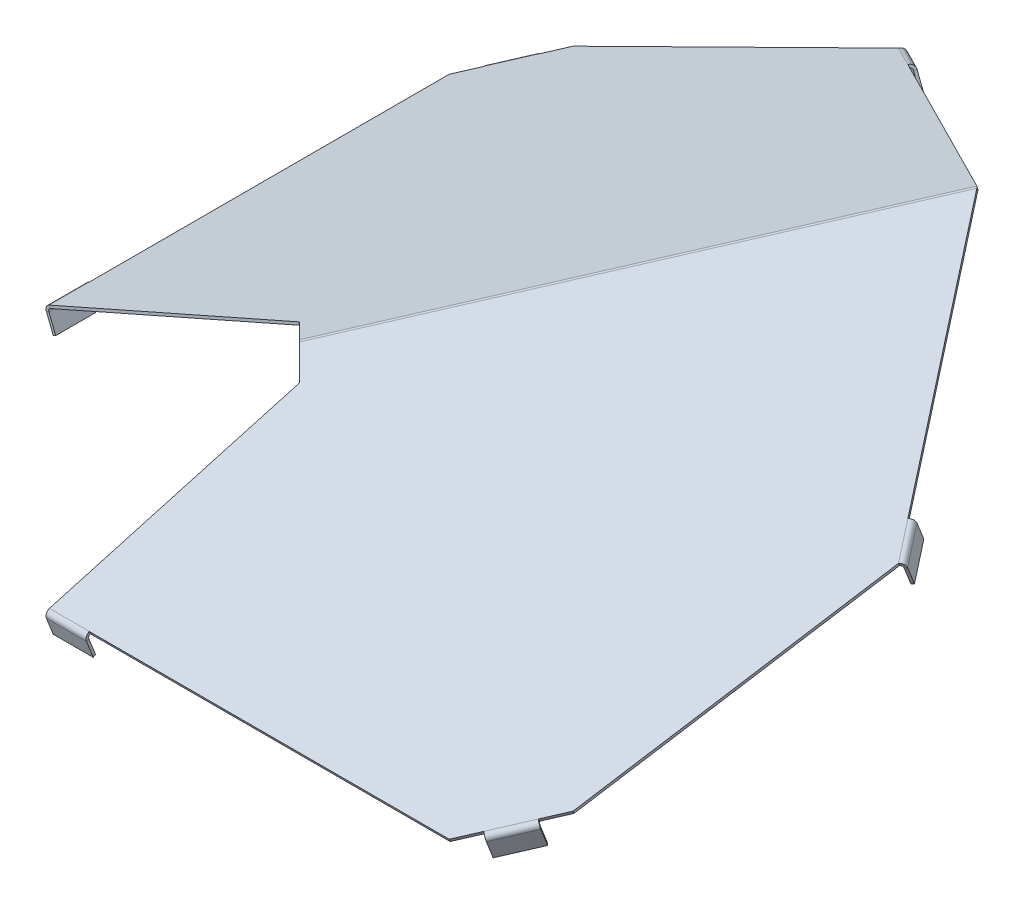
ISO-10303-21;
HEADER;
FILE_DESCRIPTION(('STEP AP214'),'2;1');
FILE_NAME('part.step','',(''),(''),'','','');
FILE_SCHEMA(('AUTOMOTIVE_DESIGN { 1 0 10303 214 1 1 1 1 }'));
ENDSEC;
DATA;
#1=APPLICATION_CONTEXT('core data for automotive mechanical design processes');
#2=APPLICATION_PROTOCOL_DEFINITION('international standard','automotive_design',2000,#1);
#3=PRODUCT_CONTEXT('',#1,'mechanical');
#4=PRODUCT('Part','Part','',(#3));
#5=PRODUCT_RELATED_PRODUCT_CATEGORY('part','',(#4));
#6=PRODUCT_DEFINITION_FORMATION('','',#4);
#7=PRODUCT_DEFINITION_CONTEXT('part definition',#1,'design');
#8=PRODUCT_DEFINITION('design','',#6,#7);
#9=PRODUCT_DEFINITION_SHAPE('','',#8);
#10=(LENGTH_UNIT() NAMED_UNIT(*) SI_UNIT(.MILLI.,.METRE.));
#11=(NAMED_UNIT(*) PLANE_ANGLE_UNIT() SI_UNIT($,.RADIAN.));
#12=(NAMED_UNIT(*) SI_UNIT($,.STERADIAN.) SOLID_ANGLE_UNIT());
#13=UNCERTAINTY_MEASURE_WITH_UNIT(LENGTH_MEASURE(1.E-05),#10,'distance_accuracy_value','');
#14=(GEOMETRIC_REPRESENTATION_CONTEXT(3) GLOBAL_UNCERTAINTY_ASSIGNED_CONTEXT((#13)) GLOBAL_UNIT_ASSIGNED_CONTEXT((#10,
#11,#12)) REPRESENTATION_CONTEXT('',''));
#15=CARTESIAN_POINT('',(0.,0.,0.));
#16=DIRECTION('',(0.,0.,1.));
#17=DIRECTION('',(1.,0.,0.));
#18=AXIS2_PLACEMENT_3D('',#15,#16,#17);
#19=CARTESIAN_POINT('',(-56.4612361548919,214.108097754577,-39.5345831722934));
#20=DIRECTION('',(-0.508149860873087,-0.199700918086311,0.837796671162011));
#21=DIRECTION('',(-0.779743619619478,-0.306436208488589,-0.545982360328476));
#22=AXIS2_PLACEMENT_3D('',#19,#20,#21);
#23=PLANE('',#22);
#24=DIRECTION('',(-0.779743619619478,-0.306436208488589,-0.545982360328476));
#25=VECTOR('',#24,1.);
#26=CARTESIAN_POINT('',(-56.4612361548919,214.108097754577,-39.5345831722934));
#27=LINE('',#26,#25);
#28=CARTESIAN_POINT('',(-0.215129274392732,236.212598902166,-0.150635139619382));
#29=VERTEX_POINT('',#28);
#30=CARTESIAN_POINT('',(-86.5261235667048,202.292713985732,-60.5862439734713));
#31=VERTEX_POINT('',#30);
#32=EDGE_CURVE('E942',#29,#31,#27,.T.);
#33=ORIENTED_EDGE('',*,*,#32,.T.);
#34=DIRECTION('',(-0.365764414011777,0.93070746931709,0.));
#35=VECTOR('',#34,1.);
#36=CARTESIAN_POINT('',(-86.5261235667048,202.292713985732,-60.5862439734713));
#37=LINE('',#36,#35);
#38=CARTESIAN_POINT('',(-86.8918879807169,203.223421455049,-60.5862439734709));
#39=VERTEX_POINT('',#38);
#40=EDGE_CURVE('E602',#31,#39,#37,.T.);
#41=ORIENTED_EDGE('',*,*,#40,.T.);
#42=DIRECTION('',(-0.779743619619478,-0.306436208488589,-0.545982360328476));
#43=VECTOR('',#42,1.);
#44=CARTESIAN_POINT('',(-56.8270005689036,215.038805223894,-39.5345831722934));
#45=LINE('',#44,#43);
#46=CARTESIAN_POINT('',(-0.580893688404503,237.143306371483,-0.150635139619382));
#47=VERTEX_POINT('',#46);
#48=EDGE_CURVE('E947',#47,#39,#45,.T.);
#49=ORIENTED_EDGE('',*,*,#48,.F.);
#50=DIRECTION('',(0.365764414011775,-0.93070746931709,0.));
#51=VECTOR('',#50,1.);
#52=CARTESIAN_POINT('',(-0.215129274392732,236.212598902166,-0.150635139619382));
#53=LINE('',#52,#51);
#54=EDGE_CURVE('E960',#29,#47,#53,.F.);
#55=ORIENTED_EDGE('',*,*,#54,.F.);
#56=EDGE_LOOP('',(#33,#41,#49,#55));
#57=FACE_BOUND('',#56,.T.);
#58=ADVANCED_FACE('F224',(#57),#23,.F.);
#59=CARTESIAN_POINT('',(-223.419269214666,149.568691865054,0.));
#60=DIRECTION('',(0.93070746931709,0.365764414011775,0.));
#61=DIRECTION('',(0.,0.,1.));
#62=AXIS2_PLACEMENT_3D('',#59,#60,#61);
#63=PLANE('',#62);
#64=DIRECTION('',(0.,0.,1.));
#65=VECTOR('',#64,1.);
#66=CARTESIAN_POINT('',(-223.053504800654,148.637984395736,0.));
#67=LINE('',#66,#65);
#68=CARTESIAN_POINT('',(-223.053504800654,148.637984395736,-25.0752035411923));
#69=VERTEX_POINT('',#68);
#70=CARTESIAN_POINT('',(-223.053504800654,148.637984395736,109.892796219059));
#71=VERTEX_POINT('',#70);
#72=EDGE_CURVE('E1124',#69,#71,#67,.T.);
#73=ORIENTED_EDGE('',*,*,#72,.T.);
#74=DIRECTION('',(-0.365764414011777,0.93070746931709,0.));
#75=VECTOR('',#74,1.);
#76=CARTESIAN_POINT('',(-223.053504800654,148.637984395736,109.892796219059));
#77=LINE('',#76,#75);
#78=CARTESIAN_POINT('',(-223.419269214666,149.568691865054,109.892796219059));
#79=VERTEX_POINT('',#78);
#80=EDGE_CURVE('E987',#71,#79,#77,.T.);
#81=ORIENTED_EDGE('',*,*,#80,.T.);
#82=DIRECTION('',(0.,0.,1.));
#83=VECTOR('',#82,1.);
#84=CARTESIAN_POINT('',(-223.419269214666,149.568691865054,0.));
#85=LINE('',#84,#83);
#86=CARTESIAN_POINT('',(-223.419269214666,149.568691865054,-25.0752035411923));
#87=VERTEX_POINT('',#86);
#88=EDGE_CURVE('E670',#87,#79,#85,.T.);
#89=ORIENTED_EDGE('',*,*,#88,.F.);
#90=DIRECTION('',(-0.365764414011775,0.93070746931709,0.));
#91=VECTOR('',#90,1.);
#92=CARTESIAN_POINT('',(-223.419269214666,149.568691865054,-25.0752035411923));
#93=LINE('',#92,#91);
#94=EDGE_CURVE('E683',#87,#69,#93,.F.);
#95=ORIENTED_EDGE('',*,*,#94,.T.);
#96=EDGE_LOOP('',(#73,#81,#89,#95));
#97=FACE_BOUND('',#96,.T.);
#98=ADVANCED_FACE('F1284',(#97),#63,.F.);
#99=CARTESIAN_POINT('',(-158.63966669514,175.026823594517,-89.8548060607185));
#100=DIRECTION('',(0.634081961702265,0.249191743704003,0.732013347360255));
#101=DIRECTION('',(-0.681290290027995,-0.267744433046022,0.681290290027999));
#102=AXIS2_PLACEMENT_3D('',#99,#100,#101);
#103=PLANE('',#102);
#104=DIRECTION('',(-0.681290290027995,-0.267744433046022,0.681290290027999));
#105=VECTOR('',#104,1.);
#106=CARTESIAN_POINT('',(-158.273902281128,174.0961161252,-89.8548060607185));
#107=LINE('',#106,#105);
#108=CARTESIAN_POINT('',(-199.83528533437,157.76265430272,-48.293423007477));
#109=VERTEX_POINT('',#108);
#110=CARTESIAN_POINT('',(-206.334717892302,155.208402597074,-41.7939904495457));
#111=VERTEX_POINT('',#110);
#112=EDGE_CURVE('E647',#109,#111,#107,.T.);
#113=ORIENTED_EDGE('',*,*,#112,.T.);
#114=DIRECTION('',(-0.365764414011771,0.930707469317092,0.));
#115=VECTOR('',#114,1.);
#116=CARTESIAN_POINT('',(-206.334717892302,155.208402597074,-41.7939904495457));
#117=LINE('',#116,#115);
#118=CARTESIAN_POINT('',(-206.700482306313,156.139110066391,-41.7939904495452));
#119=VERTEX_POINT('',#118);
#120=EDGE_CURVE('E1069',#111,#119,#117,.T.);
#121=ORIENTED_EDGE('',*,*,#120,.T.);
#122=DIRECTION('',(-0.681290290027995,-0.267744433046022,0.681290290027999));
#123=VECTOR('',#122,1.);
#124=CARTESIAN_POINT('',(-158.63966669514,175.026823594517,-89.8548060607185));
#125=LINE('',#124,#123);
#126=CARTESIAN_POINT('',(-200.201049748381,158.693361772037,-48.293423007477));
#127=VERTEX_POINT('',#126);
#128=EDGE_CURVE('E669',#127,#119,#125,.T.);
#129=ORIENTED_EDGE('',*,*,#128,.F.);
#130=DIRECTION('',(-0.365764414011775,0.93070746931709,0.));
#131=VECTOR('',#130,1.);
#132=CARTESIAN_POINT('',(-200.201049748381,158.693361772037,-48.293423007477));
#133=LINE('',#132,#131);
#134=EDGE_CURVE('E681',#127,#109,#133,.F.);
#135=ORIENTED_EDGE('',*,*,#134,.T.);
#136=EDGE_LOOP('',(#113,#121,#129,#135));
#137=FACE_BOUND('',#136,.T.);
#138=ADVANCED_FACE('F1188',(#137),#103,.F.);
#139=CARTESIAN_POINT('',(89.8548060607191,175.026823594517,158.63966669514));
#140=DIRECTION('',(-0.732013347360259,0.249191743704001,-0.634081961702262));
#141=DIRECTION('',(-0.681290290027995,-0.267744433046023,0.681290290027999));
#142=AXIS2_PLACEMENT_3D('',#139,#140,#141);
#143=PLANE('',#142);
#144=DIRECTION('',(-0.681290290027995,-0.267744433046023,0.681290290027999));
#145=VECTOR('',#144,1.);
#146=CARTESIAN_POINT('',(89.8548060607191,174.0961161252,158.273902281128));
#147=LINE('',#146,#145);
#148=CARTESIAN_POINT('',(31.5746360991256,151.192236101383,216.554072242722));
#149=VERTEX_POINT('',#148);
#150=CARTESIAN_POINT('',(25.0752035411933,148.637984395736,223.053504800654));
#151=VERTEX_POINT('',#150);
#152=EDGE_CURVE('E828',#149,#151,#147,.T.);
#153=ORIENTED_EDGE('',*,*,#152,.F.);
#154=DIRECTION('',(0.,0.930707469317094,0.365764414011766));
#155=VECTOR('',#154,1.);
#156=CARTESIAN_POINT('',(31.5746360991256,151.192236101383,216.554072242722));
#157=LINE('',#156,#155);
#158=CARTESIAN_POINT('',(31.5746360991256,152.1229435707,216.919836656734));
#159=VERTEX_POINT('',#158);
#160=EDGE_CURVE('E774',#149,#159,#157,.T.);
#161=ORIENTED_EDGE('',*,*,#160,.T.);
#162=DIRECTION('',(-0.681290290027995,-0.267744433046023,0.681290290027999));
#163=VECTOR('',#162,1.);
#164=CARTESIAN_POINT('',(89.8548060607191,175.026823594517,158.63966669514));
#165=LINE('',#164,#163);
#166=CARTESIAN_POINT('',(25.0752035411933,149.568691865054,223.419269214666));
#167=VERTEX_POINT('',#166);
#168=EDGE_CURVE('E701',#159,#167,#165,.T.);
#169=ORIENTED_EDGE('',*,*,#168,.T.);
#170=DIRECTION('',(0.,0.930707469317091,0.365764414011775));
#171=VECTOR('',#170,1.);
#172=CARTESIAN_POINT('',(25.0752035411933,149.568691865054,223.419269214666));
#173=LINE('',#172,#171);
#174=EDGE_CURVE('E711',#167,#151,#173,.F.);
#175=ORIENTED_EDGE('',*,*,#174,.T.);
#176=EDGE_LOOP('',(#153,#161,#169,#175));
#177=FACE_BOUND('',#176,.T.);
#178=ADVANCED_FACE('F854',(#177),#143,.F.);
#179=CARTESIAN_POINT('',(-42.9073670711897,218.360264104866,42.9073670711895));
#180=DIRECTION('',(0.681290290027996,0.267744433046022,-0.681290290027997));
#181=DIRECTION('',(-0.707106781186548,0.,-0.707106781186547));
#182=AXIS2_PLACEMENT_3D('',#179,#180,#181);
#183=CYLINDRICAL_SURFACE('',#182,1.);
#184=CARTESIAN_POINT('',(-127.279220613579,185.202453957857,127.279220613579));
#185=DIRECTION('',(0.687470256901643,-0.234028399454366,-0.687470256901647));
#186=DIRECTION('',(0.16548306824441,0.972229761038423,-0.165483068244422));
#187=AXIS2_PLACEMENT_3D('',#184,#185,#186);
#188=ELLIPSE('',#187,1.14406812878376,1.);
#189=CARTESIAN_POINT('',(-126.913456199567,186.276905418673,127.279220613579));
#190=VERTEX_POINT('',#189);
#191=CARTESIAN_POINT('',(-127.279220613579,186.276905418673,126.913456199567));
#192=VERTEX_POINT('',#191);
#193=EDGE_CURVE('E1214',#190,#192,#188,.F.);
#194=ORIENTED_EDGE('',*,*,#193,.T.);
#195=DIRECTION('',(0.681290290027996,0.267744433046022,-0.681290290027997));
#196=VECTOR('',#195,1.);
#197=CARTESIAN_POINT('',(-43.2731314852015,219.290971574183,42.9073670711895));
#198=LINE('',#197,#196);
#199=EDGE_CURVE('E694',#192,#29,#198,.T.);
#200=ORIENTED_EDGE('',*,*,#199,.T.);
#201=CARTESIAN_POINT('',(-1.94289029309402E-13,235.222692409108,-1.45716771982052E-13));
#202=DIRECTION('',(-0.573576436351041,0.,0.819152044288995));
#203=DIRECTION('',(0.434090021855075,0.848043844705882,0.303953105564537));
#204=AXIS2_PLACEMENT_3D('',#201,#202,#203);
#205=ELLIPSE('',#204,1.0539047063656,1.);
#206=CARTESIAN_POINT('',(0.,236.260585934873,0.));
#207=VERTEX_POINT('',#206);
#208=EDGE_CURVE('E1208',#29,#207,#205,.F.);
#209=ORIENTED_EDGE('',*,*,#208,.T.);
#210=CARTESIAN_POINT('',(-1.2490009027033E-13,235.222692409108,-2.15105711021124E-13));
#211=DIRECTION('',(-0.819152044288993,0.,0.573576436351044));
#212=DIRECTION('',(-0.303953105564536,0.848043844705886,-0.434090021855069));
#213=AXIS2_PLACEMENT_3D('',#210,#211,#212);
#214=ELLIPSE('',#213,1.0539047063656,1.);
#215=CARTESIAN_POINT('',(0.150635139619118,236.212598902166,0.215129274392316));
#216=VERTEX_POINT('',#215);
#217=EDGE_CURVE('E773',#207,#216,#214,.F.);
#218=ORIENTED_EDGE('',*,*,#217,.T.);
#219=DIRECTION('',(0.681290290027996,0.267744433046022,-0.681290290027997));
#220=VECTOR('',#219,1.);
#221=CARTESIAN_POINT('',(-42.9073670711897,219.290971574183,43.2731314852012));
#222=LINE('',#221,#220);
#223=EDGE_CURVE('E685',#216,#190,#222,.F.);
#224=ORIENTED_EDGE('',*,*,#223,.T.);
#225=EDGE_LOOP('',(#194,#200,#209,#218,#224));
#226=FACE_BOUND('',#225,.T.);
#227=ADVANCED_FACE('F226',(#226),#183,.F.);
#228=CARTESIAN_POINT('',(0.,204.684459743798,80.4401962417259));
#229=DIRECTION('',(0.,0.930707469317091,0.365764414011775));
#230=DIRECTION('',(0.,-0.365764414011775,0.930707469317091));
#231=AXIS2_PLACEMENT_3D('',#228,#229,#230);
#232=PLANE('',#231);
#233=DIRECTION('',(-0.681290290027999,0.267744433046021,-0.681290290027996));
#234=VECTOR('',#233,1.);
#235=CARTESIAN_POINT('',(-93.1041443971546,172.989977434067,161.088532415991));
#236=LINE('',#235,#234);
#237=CARTESIAN_POINT('',(-117.379725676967,182.530186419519,136.812951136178));
#238=VERTEX_POINT('',#237);
#239=EDGE_CURVE('E839',#238,#190,#236,.T.);
#240=ORIENTED_EDGE('',*,*,#239,.T.);
#241=ORIENTED_EDGE('',*,*,#223,.F.);
#242=DIRECTION('',(0.545982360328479,-0.306436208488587,0.779743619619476));
#243=VECTOR('',#242,1.);
#244=CARTESIAN_POINT('',(39.5345831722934,214.108097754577,56.4612361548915));
#245=LINE('',#244,#243);
#246=CARTESIAN_POINT('',(60.5862439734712,202.292713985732,86.5261235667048));
#247=VERTEX_POINT('',#246);
#248=EDGE_CURVE('E893',#216,#247,#245,.T.);
#249=ORIENTED_EDGE('',*,*,#248,.T.);
#250=DIRECTION('',(0.545982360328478,-0.30643620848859,0.779743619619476));
#251=VECTOR('',#250,1.);
#252=CARTESIAN_POINT('',(68.7759793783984,197.696170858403,98.222277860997));
#253=LINE('',#252,#251);
#254=CARTESIAN_POINT('',(68.7759793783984,197.696170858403,98.222277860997));
#255=VERTEX_POINT('',#254);
#256=EDGE_CURVE('E1032',#255,#247,#253,.F.);
#257=ORIENTED_EDGE('',*,*,#256,.F.);
#258=DIRECTION('',(-0.184389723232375,-0.359492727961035,0.914748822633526));
#259=VECTOR('',#258,1.);
#260=CARTESIAN_POINT('',(69.9001654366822,199.887923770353,92.6452432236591));
#261=LINE('',#260,#259);
#262=CARTESIAN_POINT('',(48.2934230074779,157.76265430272,199.835285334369));
#263=VERTEX_POINT('',#262);
#264=EDGE_CURVE('E827',#255,#263,#261,.T.);
#265=ORIENTED_EDGE('',*,*,#264,.T.);
#266=CARTESIAN_POINT('',(41.7939904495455,155.208402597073,206.334717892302));
#267=VERTEX_POINT('',#266);
#268=EDGE_CURVE('E821',#263,#267,#147,.T.);
#269=ORIENTED_EDGE('',*,*,#268,.T.);
#270=DIRECTION('',(-0.681290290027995,-0.267744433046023,0.681290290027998));
#271=VECTOR('',#270,1.);
#272=CARTESIAN_POINT('',(31.5746360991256,151.192236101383,216.554072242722));
#273=LINE('',#272,#271);
#274=EDGE_CURVE('E781',#149,#267,#273,.F.);
#275=ORIENTED_EDGE('',*,*,#274,.F.);
#276=ORIENTED_EDGE('',*,*,#152,.T.);
#277=DIRECTION('',(1.,0.,0.));
#278=VECTOR('',#277,1.);
#279=CARTESIAN_POINT('',(0.,148.637984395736,223.053504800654));
#280=LINE('',#279,#278);
#281=CARTESIAN_POINT('',(-109.89279621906,148.637984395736,223.053504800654));
#282=VERTEX_POINT('',#281);
#283=EDGE_CURVE('E717',#151,#282,#280,.F.);
#284=ORIENTED_EDGE('',*,*,#283,.T.);
#285=DIRECTION('',(-1.,0.,0.));
#286=VECTOR('',#285,1.);
#287=CARTESIAN_POINT('',(-124.89279621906,148.637984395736,223.053504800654));
#288=LINE('',#287,#286);
#289=CARTESIAN_POINT('',(-124.89279621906,148.637984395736,223.053504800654));
#290=VERTEX_POINT('',#289);
#291=EDGE_CURVE('E885',#290,#282,#288,.F.);
#292=ORIENTED_EDGE('',*,*,#291,.F.);
#293=DIRECTION('',(0.0811577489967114,0.364557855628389,-0.927637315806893));
#294=VECTOR('',#293,1.);
#295=CARTESIAN_POINT('',(-111.675313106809,208.010470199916,71.9769815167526));
#296=LINE('',#295,#294);
#297=CARTESIAN_POINT('',(-117.379725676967,182.38644242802,137.17871555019));
#298=VERTEX_POINT('',#297);
#299=EDGE_CURVE('E898',#290,#298,#296,.T.);
#300=ORIENTED_EDGE('',*,*,#299,.T.);
#301=DIRECTION('',(-0.681290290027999,0.267744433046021,-0.681290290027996));
#302=VECTOR('',#301,1.);
#303=CARTESIAN_POINT('',(-93.3001368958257,172.923257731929,161.258304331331));
#304=LINE('',#303,#302);
#305=CARTESIAN_POINT('',(-117.409151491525,182.398006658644,137.149289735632));
#306=VERTEX_POINT('',#305);
#307=EDGE_CURVE('E922',#298,#306,#304,.T.);
#308=ORIENTED_EDGE('',*,*,#307,.T.);
#309=DIRECTION('',(0.0811577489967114,0.364557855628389,-0.927637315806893));
#310=VECTOR('',#309,1.);
#311=CARTESIAN_POINT('',(-111.70710257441,208.011416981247,71.9745723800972));
#312=LINE('',#311,#310);
#313=EDGE_CURVE('E716',#306,#238,#312,.T.);
#314=ORIENTED_EDGE('',*,*,#313,.T.);
#315=EDGE_LOOP('',(#240,#241,#249,#257,#265,#269,#275,#276,#284,#292,#300,#308,#314));
#316=FACE_BOUND('',#315,.T.);
#317=ADVANCED_FACE('F825',(#316),#232,.F.);
#318=CARTESIAN_POINT('',(-80.440196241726,204.684459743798,0.));
#319=DIRECTION('',(0.365764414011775,-0.93070746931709,0.));
#320=DIRECTION('',(0.93070746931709,0.365764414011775,0.));
#321=AXIS2_PLACEMENT_3D('',#318,#319,#320);
#322=PLANE('',#321);
#323=ORIENTED_EDGE('',*,*,#199,.F.);
#324=DIRECTION('',(0.681290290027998,0.267744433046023,0.681290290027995));
#325=VECTOR('',#324,1.);
#326=CARTESIAN_POINT('',(-161.08853241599,172.989977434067,93.104144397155));
#327=LINE('',#326,#325);
#328=CARTESIAN_POINT('',(-136.812951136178,182.530186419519,117.379725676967));
#329=VERTEX_POINT('',#328);
#330=EDGE_CURVE('E657',#329,#192,#327,.T.);
#331=ORIENTED_EDGE('',*,*,#330,.F.);
#332=DIRECTION('',(0.927637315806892,0.36455785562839,-0.0811577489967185));
#333=VECTOR('',#332,1.);
#334=CARTESIAN_POINT('',(-71.9745723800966,208.011416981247,111.70710257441));
#335=LINE('',#334,#333);
#336=CARTESIAN_POINT('',(-137.149289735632,182.398006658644,117.409151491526));
#337=VERTEX_POINT('',#336);
#338=EDGE_CURVE('E1005',#337,#329,#335,.T.);
#339=ORIENTED_EDGE('',*,*,#338,.F.);
#340=DIRECTION('',(0.681290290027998,0.267744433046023,0.681290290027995));
#341=VECTOR('',#340,1.);
#342=CARTESIAN_POINT('',(-161.258304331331,172.92325773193,93.3001368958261));
#343=LINE('',#342,#341);
#344=CARTESIAN_POINT('',(-137.17871555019,182.38644242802,117.379725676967));
#345=VERTEX_POINT('',#344);
#346=EDGE_CURVE('E955',#345,#337,#343,.T.);
#347=ORIENTED_EDGE('',*,*,#346,.F.);
#348=DIRECTION('',(0.927637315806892,0.36455785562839,-0.0811577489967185));
#349=VECTOR('',#348,1.);
#350=CARTESIAN_POINT('',(-71.976981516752,208.010470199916,111.675313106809));
#351=LINE('',#350,#349);
#352=CARTESIAN_POINT('',(-223.053504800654,148.637984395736,124.892796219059));
#353=VERTEX_POINT('',#352);
#354=EDGE_CURVE('E998',#353,#345,#351,.T.);
#355=ORIENTED_EDGE('',*,*,#354,.F.);
#356=DIRECTION('',(0.,0.,-1.));
#357=VECTOR('',#356,1.);
#358=CARTESIAN_POINT('',(-223.053504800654,148.637984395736,109.892796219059));
#359=LINE('',#358,#357);
#360=EDGE_CURVE('E2162',#71,#353,#359,.F.);
#361=ORIENTED_EDGE('',*,*,#360,.F.);
#362=ORIENTED_EDGE('',*,*,#72,.F.);
#363=CARTESIAN_POINT('',(-216.554072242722,151.192236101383,-31.5746360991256));
#364=VERTEX_POINT('',#363);
#365=EDGE_CURVE('E653',#364,#69,#107,.T.);
#366=ORIENTED_EDGE('',*,*,#365,.F.);
#367=DIRECTION('',(0.681290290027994,0.267744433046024,-0.681290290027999));
#368=VECTOR('',#367,1.);
#369=CARTESIAN_POINT('',(-206.334717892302,155.208402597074,-41.7939904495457));
#370=LINE('',#369,#368);
#371=EDGE_CURVE('E1101',#111,#364,#370,.F.);
#372=ORIENTED_EDGE('',*,*,#371,.F.);
#373=ORIENTED_EDGE('',*,*,#112,.F.);
#374=DIRECTION('',(-0.914748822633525,-0.359492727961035,0.184389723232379));
#375=VECTOR('',#374,1.);
#376=CARTESIAN_POINT('',(-92.6452432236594,199.887923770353,-69.9001654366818));
#377=LINE('',#376,#375);
#378=CARTESIAN_POINT('',(-98.222277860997,197.696170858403,-68.7759793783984));
#379=VERTEX_POINT('',#378);
#380=EDGE_CURVE('E635',#379,#109,#377,.T.);
#381=ORIENTED_EDGE('',*,*,#380,.F.);
#382=DIRECTION('',(0.779743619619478,0.30643620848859,0.545982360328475));
#383=VECTOR('',#382,1.);
#384=CARTESIAN_POINT('',(-86.5261235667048,202.292713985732,-60.5862439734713));
#385=LINE('',#384,#383);
#386=EDGE_CURVE('E605',#31,#379,#385,.F.);
#387=ORIENTED_EDGE('',*,*,#386,.F.);
#388=ORIENTED_EDGE('',*,*,#32,.F.);
#389=EDGE_LOOP('',(#323,#331,#339,#347,#355,#361,#362,#366,#372,#373,#381,#387,#388));
#390=FACE_BOUND('',#389,.T.);
#391=ADVANCED_FACE('F644',(#390),#322,.T.);
#392=DIRECTION('',(-0.365764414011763,0.930707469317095,0.));
#393=VECTOR('',#392,1.);
#394=CARTESIAN_POINT('',(-216.554072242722,151.192236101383,-31.5746360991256));
#395=LINE('',#394,#393);
#396=CARTESIAN_POINT('',(-216.919836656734,152.1229435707,-31.5746360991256));
#397=VERTEX_POINT('',#396);
#398=EDGE_CURVE('E1068',#364,#397,#395,.T.);
#399=ORIENTED_EDGE('',*,*,#398,.F.);
#400=ORIENTED_EDGE('',*,*,#365,.T.);
#401=ORIENTED_EDGE('',*,*,#94,.F.);
#402=EDGE_CURVE('E666',#397,#87,#125,.T.);
#403=ORIENTED_EDGE('',*,*,#402,.F.);
#404=EDGE_LOOP('',(#399,#400,#401,#403));
#405=FACE_BOUND('',#404,.T.);
#406=ADVANCED_FACE('F1303',(#405),#103,.F.);
#407=DIRECTION('',(0.,0.930707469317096,0.365764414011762));
#408=VECTOR('',#407,1.);
#409=CARTESIAN_POINT('',(41.7939904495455,155.208402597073,206.334717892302));
#410=LINE('',#409,#408);
#411=CARTESIAN_POINT('',(41.7939904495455,156.139110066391,206.700482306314));
#412=VERTEX_POINT('',#411);
#413=EDGE_CURVE('E770',#267,#412,#410,.T.);
#414=ORIENTED_EDGE('',*,*,#413,.F.);
#415=ORIENTED_EDGE('',*,*,#268,.F.);
#416=DIRECTION('',(0.,0.930707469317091,0.365764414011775));
#417=VECTOR('',#416,1.);
#418=CARTESIAN_POINT('',(48.2934230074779,158.693361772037,200.201049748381));
#419=LINE('',#418,#417);
#420=CARTESIAN_POINT('',(48.2934230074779,158.693361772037,200.201049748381));
#421=VERTEX_POINT('',#420);
#422=EDGE_CURVE('E860',#421,#263,#419,.F.);
#423=ORIENTED_EDGE('',*,*,#422,.F.);
#424=EDGE_CURVE('E696',#421,#412,#165,.T.);
#425=ORIENTED_EDGE('',*,*,#424,.T.);
#426=EDGE_LOOP('',(#414,#415,#423,#425));
#427=FACE_BOUND('',#426,.T.);
#428=ADVANCED_FACE('F819',(#427),#143,.F.);
#429=CARTESIAN_POINT('',(-127.279220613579,187.278241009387,127.279220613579));
#430=CARTESIAN_POINT('',(-127.216112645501,186.957077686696,127.216112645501));
#431=CARTESIAN_POINT('',(-127.153004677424,186.635914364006,127.153004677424));
#432=CARTESIAN_POINT('',(-127.089896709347,186.314751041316,127.089896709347));
#433=CARTESIAN_POINT('',(-130.107647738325,187.278241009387,124.450793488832));
#434=CARTESIAN_POINT('',(-129.573135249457,186.957077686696,124.859090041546));
#435=CARTESIAN_POINT('',(-129.038622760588,186.635914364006,125.26738659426));
#436=CARTESIAN_POINT('',(-128.50411027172,186.314751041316,125.675683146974));
#437=CARTESIAN_POINT('',(-130.107647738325,183.126666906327,124.450793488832));
#438=CARTESIAN_POINT('',(-129.699351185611,183.447830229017,124.985305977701));
#439=CARTESIAN_POINT('',(-129.291054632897,183.768993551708,125.519818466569));
#440=CARTESIAN_POINT('',(-128.882758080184,184.090156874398,126.054330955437));
#441=CARTESIAN_POINT('',(-127.279220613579,183.126666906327,127.279220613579));
#442=CARTESIAN_POINT('',(-127.342328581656,183.447830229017,127.342328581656));
#443=CARTESIAN_POINT('',(-127.405436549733,183.768993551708,127.405436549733));
#444=CARTESIAN_POINT('',(-127.46854451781,184.090156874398,127.46854451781));
#445=CARTESIAN_POINT('',(-124.450793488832,183.126666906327,130.107647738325));
#446=CARTESIAN_POINT('',(-124.985305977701,183.447830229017,129.699351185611));
#447=CARTESIAN_POINT('',(-125.519818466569,183.768993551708,129.291054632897));
#448=CARTESIAN_POINT('',(-126.054330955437,184.090156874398,128.882758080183));
#449=CARTESIAN_POINT('',(-124.450793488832,187.278241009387,130.107647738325));
#450=CARTESIAN_POINT('',(-124.859090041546,186.957077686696,129.573135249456));
#451=CARTESIAN_POINT('',(-125.26738659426,186.635914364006,129.038622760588));
#452=CARTESIAN_POINT('',(-125.675683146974,186.314751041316,128.50411027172));
#453=CARTESIAN_POINT('',(-127.279220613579,187.278241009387,127.279220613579));
#454=CARTESIAN_POINT('',(-127.216112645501,186.957077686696,127.216112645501));
#455=CARTESIAN_POINT('',(-127.153004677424,186.635914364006,127.153004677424));
#456=CARTESIAN_POINT('',(-127.089896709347,186.314751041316,127.089896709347));
#457=(BOUNDED_SURFACE() B_SPLINE_SURFACE(3,3,((#429,#430,#431,#432),(#433,#434,#435,#436),(#437,
#438,#439,#440),(#441,#442,#443,#444),(#445,#446,#447,#448),(#449,#450,#451,#452),(#453,#454,
#455,#456)),.UNSPECIFIED.,.T.,.F.,.F.) B_SPLINE_SURFACE_WITH_KNOTS((4,3,4),(4,4),(0.,0.5,1.),
(0.,1.),.UNSPECIFIED.) GEOMETRIC_REPRESENTATION_ITEM() RATIONAL_B_SPLINE_SURFACE(((1.,1.,1.,1.),
(0.333333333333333,0.333333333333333,0.333333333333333,0.333333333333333),(0.333333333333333,
0.333333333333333,0.333333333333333,0.333333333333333),(1.,1.,1.,1.),(0.333333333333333,
0.333333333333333,0.333333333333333,0.333333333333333),(0.333333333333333,0.333333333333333,
0.333333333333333,0.333333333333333),(1.,1.,1.,1.))) REPRESENTATION_ITEM('') SURFACE());
#458=CARTESIAN_POINT('',(-127.279220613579,185.202453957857,127.279220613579));
#459=DIRECTION('',(0.707106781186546,0.,-0.707106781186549));
#460=DIRECTION('',(0.,1.,0.));
#461=AXIS2_PLACEMENT_3D('',#458,#459,#460);
#462=ELLIPSE('',#461,2.0757870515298,2.);
#463=CARTESIAN_POINT('',(-126.913456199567,187.20761288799,127.64498502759));
#464=VERTEX_POINT('',#463);
#465=CARTESIAN_POINT('',(-127.64498502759,187.20761288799,126.913456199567));
#466=VERTEX_POINT('',#465);
#467=EDGE_CURVE('E1206',#464,#466,#462,.F.);
#468=DIRECTION('',(-0.365764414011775,0.93070746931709,0.));
#469=VECTOR('',#468,1.);
#470=CARTESIAN_POINT('',(-127.64498502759,187.20761288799,126.913456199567));
#471=LINE('',#470,#469);
#472=EDGE_CURVE('E651',#466,#192,#471,.F.);
#473=DIRECTION('',(0.,0.930707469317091,0.365764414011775));
#474=VECTOR('',#473,1.);
#475=CARTESIAN_POINT('',(-126.913456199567,187.20761288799,127.64498502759));
#476=LINE('',#475,#474);
#477=EDGE_CURVE('E937',#464,#190,#476,.F.);
#478=ORIENTED_EDGE('',*,*,#467,.T.);
#479=ORIENTED_EDGE('',*,*,#472,.T.);
#480=ORIENTED_EDGE('',*,*,#193,.F.);
#481=ORIENTED_EDGE('',*,*,#477,.F.);
#482=EDGE_LOOP('',(#478,#479,#480,#481));
#483=FACE_BOUND('',#482,.T.);
#484=ADVANCED_FACE('F1335',(#483),#457,.T.);
#485=CARTESIAN_POINT('',(-93.1041443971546,173.920684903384,161.454296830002));
#486=DIRECTION('',(0.732013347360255,0.249191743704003,-0.634081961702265));
#487=DIRECTION('',(-0.681290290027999,0.267744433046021,-0.681290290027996));
#488=AXIS2_PLACEMENT_3D('',#485,#486,#487);
#489=PLANE('',#488);
#490=DIRECTION('',(-0.681290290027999,0.267744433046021,-0.681290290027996));
#491=VECTOR('',#490,1.);
#492=CARTESIAN_POINT('',(-93.1041443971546,173.920684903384,161.454296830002));
#493=LINE('',#492,#491);
#494=CARTESIAN_POINT('',(-117.379725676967,183.460893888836,137.17871555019));
#495=VERTEX_POINT('',#494);
#496=EDGE_CURVE('E842',#495,#464,#493,.T.);
#497=ORIENTED_EDGE('',*,*,#496,.T.);
#498=ORIENTED_EDGE('',*,*,#477,.T.);
#499=ORIENTED_EDGE('',*,*,#239,.F.);
#500=DIRECTION('',(0.,0.930707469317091,0.365764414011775));
#501=VECTOR('',#500,1.);
#502=CARTESIAN_POINT('',(-117.379725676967,183.460893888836,137.17871555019));
#503=LINE('',#502,#501);
#504=EDGE_CURVE('E830',#495,#238,#503,.F.);
#505=ORIENTED_EDGE('',*,*,#504,.F.);
#506=EDGE_LOOP('',(#497,#498,#499,#505));
#507=FACE_BOUND('',#506,.T.);
#508=ADVANCED_FACE('F933',(#507),#489,.F.);
#509=CARTESIAN_POINT('',(-111.675313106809,208.010470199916,71.9769815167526));
#510=DIRECTION('',(0.996701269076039,-0.0296846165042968,0.075534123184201));
#511=DIRECTION('',(0.0811577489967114,0.364557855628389,-0.927637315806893));
#512=AXIS2_PLACEMENT_3D('',#509,#510,#511);
#513=PLANE('',#512);
#514=DIRECTION('',(0.0811577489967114,0.364557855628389,-0.927637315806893));
#515=VECTOR('',#514,1.);
#516=CARTESIAN_POINT('',(-111.675313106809,208.941177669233,72.3427459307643));
#517=LINE('',#516,#515);
#518=CARTESIAN_POINT('',(-124.89279621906,149.568691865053,223.419269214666));
#519=VERTEX_POINT('',#518);
#520=CARTESIAN_POINT('',(-117.379725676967,183.317149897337,137.544479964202));
#521=VERTEX_POINT('',#520);
#522=EDGE_CURVE('E865',#519,#521,#517,.T.);
#523=ORIENTED_EDGE('',*,*,#522,.T.);
#524=DIRECTION('',(0.,-0.930707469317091,-0.365764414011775));
#525=VECTOR('',#524,1.);
#526=CARTESIAN_POINT('',(-117.379725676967,182.38644242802,137.17871555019));
#527=LINE('',#526,#525);
#528=EDGE_CURVE('E910',#298,#521,#527,.F.);
#529=ORIENTED_EDGE('',*,*,#528,.F.);
#530=ORIENTED_EDGE('',*,*,#299,.F.);
#531=DIRECTION('',(0.,-0.930707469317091,-0.365764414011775));
#532=VECTOR('',#531,1.);
#533=CARTESIAN_POINT('',(-124.89279621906,149.568691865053,223.419269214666));
#534=LINE('',#533,#532);
#535=EDGE_CURVE('E909',#519,#290,#534,.T.);
#536=ORIENTED_EDGE('',*,*,#535,.F.);
#537=EDGE_LOOP('',(#523,#529,#530,#536));
#538=FACE_BOUND('',#537,.T.);
#539=ADVANCED_FACE('F1222',(#538),#513,.F.);
#540=CARTESIAN_POINT('',(-93.3001368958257,172.923257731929,161.258304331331));
#541=DIRECTION('',(0.732013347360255,0.249191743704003,-0.634081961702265));
#542=DIRECTION('',(-0.681290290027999,0.267744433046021,-0.681290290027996));
#543=AXIS2_PLACEMENT_3D('',#540,#541,#542);
#544=PLANE('',#543);
#545=ORIENTED_EDGE('',*,*,#307,.F.);
#546=ORIENTED_EDGE('',*,*,#528,.T.);
#547=DIRECTION('',(-0.681290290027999,0.267744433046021,-0.681290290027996));
#548=VECTOR('',#547,1.);
#549=CARTESIAN_POINT('',(-93.3001368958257,173.853965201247,161.624068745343));
#550=LINE('',#549,#548);
#551=CARTESIAN_POINT('',(-117.409151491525,183.328714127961,137.515054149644));
#552=VERTEX_POINT('',#551);
#553=EDGE_CURVE('E897',#521,#552,#550,.T.);
#554=ORIENTED_EDGE('',*,*,#553,.T.);
#555=DIRECTION('',(0.,0.930707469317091,0.365764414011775));
#556=VECTOR('',#555,1.);
#557=CARTESIAN_POINT('',(-117.409151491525,183.328714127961,137.515054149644));
#558=LINE('',#557,#556);
#559=EDGE_CURVE('E915',#306,#552,#558,.T.);
#560=ORIENTED_EDGE('',*,*,#559,.F.);
#561=EDGE_LOOP('',(#545,#546,#554,#560));
#562=FACE_BOUND('',#561,.T.);
#563=ADVANCED_FACE('F929',(#562),#544,.F.);
#564=CARTESIAN_POINT('',(-111.70710257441,208.942124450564,72.340336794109));
#565=DIRECTION('',(0.996701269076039,-0.0296846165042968,0.075534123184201));
#566=DIRECTION('',(0.0811577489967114,0.364557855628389,-0.927637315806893));
#567=AXIS2_PLACEMENT_3D('',#564,#565,#566);
#568=PLANE('',#567);
#569=ORIENTED_EDGE('',*,*,#559,.T.);
#570=DIRECTION('',(0.0811577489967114,0.364557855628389,-0.927637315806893));
#571=VECTOR('',#570,1.);
#572=CARTESIAN_POINT('',(-111.70710257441,208.942124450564,72.340336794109));
#573=LINE('',#572,#571);
#574=EDGE_CURVE('E841',#552,#495,#573,.T.);
#575=ORIENTED_EDGE('',*,*,#574,.T.);
#576=ORIENTED_EDGE('',*,*,#504,.T.);
#577=ORIENTED_EDGE('',*,*,#313,.F.);
#578=EDGE_LOOP('',(#569,#575,#576,#577));
#579=FACE_BOUND('',#578,.T.);
#580=ADVANCED_FACE('F926',(#579),#568,.F.);
#581=CARTESIAN_POINT('',(5.34977888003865E-13,149.568691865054,223.419269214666));
#582=DIRECTION('',(0.,0.365764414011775,-0.930707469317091));
#583=DIRECTION('',(-1.,0.,0.));
#584=AXIS2_PLACEMENT_3D('',#581,#582,#583);
#585=PLANE('',#584);
#586=DIRECTION('',(0.,0.930707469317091,0.365764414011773));
#587=VECTOR('',#586,1.);
#588=CARTESIAN_POINT('',(-109.89279621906,148.637984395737,223.053504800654));
#589=LINE('',#588,#587);
#590=CARTESIAN_POINT('',(-109.89279621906,149.568691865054,223.419269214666));
#591=VERTEX_POINT('',#590);
#592=EDGE_CURVE('E720',#282,#591,#589,.T.);
#593=ORIENTED_EDGE('',*,*,#592,.F.);
#594=ORIENTED_EDGE('',*,*,#283,.F.);
#595=ORIENTED_EDGE('',*,*,#174,.F.);
#596=DIRECTION('',(-1.,0.,0.));
#597=VECTOR('',#596,1.);
#598=CARTESIAN_POINT('',(5.34977888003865E-13,149.568691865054,223.419269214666));
#599=LINE('',#598,#597);
#600=EDGE_CURVE('E700',#167,#591,#599,.T.);
#601=ORIENTED_EDGE('',*,*,#600,.T.);
#602=EDGE_LOOP('',(#593,#594,#595,#601));
#603=FACE_BOUND('',#602,.T.);
#604=ADVANCED_FACE('F858',(#603),#585,.F.);
#605=CARTESIAN_POINT('',(0.688287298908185,236.92111823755,0.867366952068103));
#606=CARTESIAN_POINT('',(0.611354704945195,236.652895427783,0.685023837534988));
#607=CARTESIAN_POINT('',(0.534422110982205,236.384672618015,0.502680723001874));
#608=CARTESIAN_POINT('',(0.457489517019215,236.116449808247,0.320337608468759));
#609=CARTESIAN_POINT('',(3.46699469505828,234.801413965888,2.81303881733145));
#610=CARTESIAN_POINT('',(2.92694420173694,234.886475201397,2.30641705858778));
#611=CARTESIAN_POINT('',(2.3868937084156,234.971536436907,1.7997952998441));
#612=CARTESIAN_POINT('',(1.84684321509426,235.056597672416,1.29317354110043));
#613=CARTESIAN_POINT('',(2.09042009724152,231.404562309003,1.07830491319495));
#614=CARTESIAN_POINT('',(1.70423479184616,232.026069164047,0.936369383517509));
#615=CARTESIAN_POINT('',(1.3180494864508,232.647576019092,0.794433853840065));
#616=CARTESIAN_POINT('',(0.931864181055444,233.269082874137,0.652498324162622));
#617=CARTESIAN_POINT('',(-0.688287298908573,233.524266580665,-0.867366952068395));
#618=CARTESIAN_POINT('',(-0.611354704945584,233.792489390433,-0.68502383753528));
#619=CARTESIAN_POINT('',(-0.534422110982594,234.0607122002,-0.502680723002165));
#620=CARTESIAN_POINT('',(-0.457489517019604,234.328935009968,-0.32033760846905));
#621=CARTESIAN_POINT('',(-3.46699469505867,235.643970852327,-2.81303881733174));
#622=CARTESIAN_POINT('',(-2.92694420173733,235.558909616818,-2.30641705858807));
#623=CARTESIAN_POINT('',(-2.38689370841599,235.473848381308,-1.7997952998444));
#624=CARTESIAN_POINT('',(-1.84684321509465,235.388787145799,-1.29317354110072));
#625=CARTESIAN_POINT('',(-2.09042009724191,239.040822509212,-1.07830491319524));
#626=CARTESIAN_POINT('',(-1.70423479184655,238.419315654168,-0.9363693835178));
#627=CARTESIAN_POINT('',(-1.31804948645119,237.797808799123,-0.794433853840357));
#628=CARTESIAN_POINT('',(-0.931864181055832,237.176301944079,-0.652498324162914));
#629=CARTESIAN_POINT('',(0.688287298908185,236.92111823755,0.867366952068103));
#630=CARTESIAN_POINT('',(0.611354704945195,236.652895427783,0.685023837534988));
#631=CARTESIAN_POINT('',(0.534422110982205,236.384672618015,0.502680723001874));
#632=CARTESIAN_POINT('',(0.457489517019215,236.116449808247,0.320337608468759));
#633=(BOUNDED_SURFACE() B_SPLINE_SURFACE(3,3,((#605,#606,#607,#608),(#609,#610,#611,#612),(#613,
#614,#615,#616),(#617,#618,#619,#620),(#621,#622,#623,#624),(#625,#626,#627,#628),(#629,#630,
#631,#632)),.UNSPECIFIED.,.T.,.F.,.F.) B_SPLINE_SURFACE_WITH_KNOTS((4,3,4),(4,4),(0.,0.5,1.),
(0.,1.),.UNSPECIFIED.) GEOMETRIC_REPRESENTATION_ITEM() RATIONAL_B_SPLINE_SURFACE(((1.,1.,1.,1.),
(0.333333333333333,0.333333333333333,0.333333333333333,0.333333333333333),(0.333333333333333,
0.333333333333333,0.333333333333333,0.333333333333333),(1.,1.,1.,1.),(0.333333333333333,
0.333333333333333,0.333333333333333,0.333333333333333),(0.333333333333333,0.333333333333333,
0.333333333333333,0.333333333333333),(1.,1.,1.,1.))) REPRESENTATION_ITEM('') SURFACE());
#634=CARTESIAN_POINT('',(-1.94289029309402E-13,235.222692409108,-1.45716771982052E-13));
#635=DIRECTION('',(-0.634175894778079,-0.132057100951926,0.761827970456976));
#636=DIRECTION('',(0.339477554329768,0.837698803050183,0.427803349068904));
#637=AXIS2_PLACEMENT_3D('',#634,#635,#636);
#638=ELLIPSE('',#637,2.027489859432,2.);
#639=CARTESIAN_POINT('',(-0.189323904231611,237.224075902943,0.189323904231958));
#640=VERTEX_POINT('',#639);
#641=EDGE_CURVE('E1197',#47,#640,#638,.F.);
#642=DIRECTION('',(0.18932390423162,-0.963489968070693,-0.18932390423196));
#643=VECTOR('',#642,1.);
#644=CARTESIAN_POINT('',(0.,236.260585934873,0.));
#645=LINE('',#644,#643);
#646=EDGE_CURVE('E1204',#207,#640,#645,.F.);
#647=ORIENTED_EDGE('',*,*,#208,.F.);
#648=ORIENTED_EDGE('',*,*,#54,.T.);
#649=ORIENTED_EDGE('',*,*,#641,.T.);
#650=ORIENTED_EDGE('',*,*,#646,.F.);
#651=EDGE_LOOP('',(#647,#648,#649,#650));
#652=FACE_BOUND('',#651,.T.);
#653=ADVANCED_FACE('F1377',(#652),#633,.T.);
#654=CARTESIAN_POINT('',(-0.867366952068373,236.92111823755,-0.688287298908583));
#655=CARTESIAN_POINT('',(-0.685023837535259,236.652895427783,-0.611354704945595));
#656=CARTESIAN_POINT('',(-0.502680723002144,236.384672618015,-0.534422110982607));
#657=CARTESIAN_POINT('',(-0.320337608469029,236.116449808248,-0.457489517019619));
#658=CARTESIAN_POINT('',(1.07830491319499,239.040822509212,2.09042009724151));
#659=CARTESIAN_POINT('',(0.936369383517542,238.419315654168,1.70423479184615));
#660=CARTESIAN_POINT('',(0.794433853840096,237.797808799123,1.31804948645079));
#661=CARTESIAN_POINT('',(0.652498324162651,237.176301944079,0.931864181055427));
#662=CARTESIAN_POINT('',(2.81303881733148,235.643970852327,3.46699469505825));
#663=CARTESIAN_POINT('',(2.30641705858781,235.558909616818,2.92694420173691));
#664=CARTESIAN_POINT('',(1.79979529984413,235.473848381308,2.38689370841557));
#665=CARTESIAN_POINT('',(1.29317354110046,235.388787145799,1.84684321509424));
#666=CARTESIAN_POINT('',(0.867366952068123,233.524266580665,0.688287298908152));
#667=CARTESIAN_POINT('',(0.685023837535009,233.792489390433,0.611354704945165));
#668=CARTESIAN_POINT('',(0.502680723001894,234.0607122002,0.534422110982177));
#669=CARTESIAN_POINT('',(0.320337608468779,234.328935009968,0.457489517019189));
#670=CARTESIAN_POINT('',(-1.07830491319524,231.404562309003,-2.09042009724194));
#671=CARTESIAN_POINT('',(-0.936369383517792,232.026069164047,-1.70423479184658));
#672=CARTESIAN_POINT('',(-0.794433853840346,232.647576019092,-1.31804948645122));
#673=CARTESIAN_POINT('',(-0.652498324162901,233.269082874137,-0.931864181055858));
#674=CARTESIAN_POINT('',(-2.81303881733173,234.801413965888,-3.46699469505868));
#675=CARTESIAN_POINT('',(-2.30641705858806,234.886475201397,-2.92694420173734));
#676=CARTESIAN_POINT('',(-1.79979529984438,234.971536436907,-2.386893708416));
#677=CARTESIAN_POINT('',(-1.29317354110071,235.056597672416,-1.84684321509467));
#678=CARTESIAN_POINT('',(-0.867366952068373,236.92111823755,-0.688287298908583));
#679=CARTESIAN_POINT('',(-0.685023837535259,236.652895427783,-0.611354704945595));
#680=CARTESIAN_POINT('',(-0.502680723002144,236.384672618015,-0.534422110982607));
#681=CARTESIAN_POINT('',(-0.320337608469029,236.116449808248,-0.457489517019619));
#682=(BOUNDED_SURFACE() B_SPLINE_SURFACE(3,3,((#654,#655,#656,#657),(#658,#659,#660,#661),(#662,
#663,#664,#665),(#666,#667,#668,#669),(#670,#671,#672,#673),(#674,#675,#676,#677),(#678,#679,
#680,#681)),.UNSPECIFIED.,.T.,.F.,.F.) B_SPLINE_SURFACE_WITH_KNOTS((4,3,4),(4,4),(0.,0.5,1.),
(0.,1.),.UNSPECIFIED.) GEOMETRIC_REPRESENTATION_ITEM() RATIONAL_B_SPLINE_SURFACE(((1.,1.,1.,1.),
(0.333333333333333,0.333333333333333,0.333333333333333,0.333333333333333),(0.333333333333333,
0.333333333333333,0.333333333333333,0.333333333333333),(1.,1.,1.,1.),(0.333333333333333,
0.333333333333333,0.333333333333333,0.333333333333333),(0.333333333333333,0.333333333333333,
0.333333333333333,0.333333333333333),(1.,1.,1.,1.))) REPRESENTATION_ITEM('') SURFACE());
#683=DIRECTION('',(0.,-0.930707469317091,-0.365764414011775));
#684=VECTOR('',#683,1.);
#685=CARTESIAN_POINT('',(0.150635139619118,236.212598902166,0.215129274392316));
#686=LINE('',#685,#684);
#687=CARTESIAN_POINT('',(0.150635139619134,237.143306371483,0.580893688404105));
#688=VERTEX_POINT('',#687);
#689=EDGE_CURVE('E906',#216,#688,#686,.F.);
#690=CARTESIAN_POINT('',(-1.2490009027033E-13,235.222692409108,-2.15105711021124E-13));
#691=DIRECTION('',(-0.761827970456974,-0.132057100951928,0.634175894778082));
#692=DIRECTION('',(-0.427803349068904,0.837698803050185,-0.339477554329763));
#693=AXIS2_PLACEMENT_3D('',#690,#691,#692);
#694=ELLIPSE('',#693,2.02748985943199,2.);
#695=EDGE_CURVE('E1201',#640,#688,#694,.F.);
#696=ORIENTED_EDGE('',*,*,#689,.F.);
#697=ORIENTED_EDGE('',*,*,#217,.F.);
#698=ORIENTED_EDGE('',*,*,#646,.T.);
#699=ORIENTED_EDGE('',*,*,#695,.T.);
#700=EDGE_LOOP('',(#696,#697,#698,#699));
#701=FACE_BOUND('',#700,.T.);
#702=ADVANCED_FACE('F1384',(#701),#682,.T.);
#703=CARTESIAN_POINT('',(39.5345831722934,214.108097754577,56.4612361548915));
#704=DIRECTION('',(-0.837796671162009,-0.199700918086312,0.50814986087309));
#705=DIRECTION('',(0.545982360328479,-0.306436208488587,0.779743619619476));
#706=AXIS2_PLACEMENT_3D('',#703,#704,#705);
#707=PLANE('',#706);
#708=DIRECTION('',(0.,0.930707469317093,0.365764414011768));
#709=VECTOR('',#708,1.);
#710=CARTESIAN_POINT('',(60.5862439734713,202.292713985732,86.5261235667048));
#711=LINE('',#710,#709);
#712=CARTESIAN_POINT('',(60.5862439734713,203.223421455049,86.8918879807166));
#713=VERTEX_POINT('',#712);
#714=EDGE_CURVE('E1045',#247,#713,#711,.T.);
#715=ORIENTED_EDGE('',*,*,#714,.F.);
#716=ORIENTED_EDGE('',*,*,#248,.F.);
#717=ORIENTED_EDGE('',*,*,#689,.T.);
#718=DIRECTION('',(0.545982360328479,-0.306436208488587,0.779743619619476));
#719=VECTOR('',#718,1.);
#720=CARTESIAN_POINT('',(39.5345831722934,215.038805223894,56.8270005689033));
#721=LINE('',#720,#719);
#722=EDGE_CURVE('E899',#688,#713,#721,.T.);
#723=ORIENTED_EDGE('',*,*,#722,.T.);
#724=EDGE_LOOP('',(#715,#716,#717,#723));
#725=FACE_BOUND('',#724,.T.);
#726=ADVANCED_FACE('F1391',(#725),#707,.F.);
#727=CARTESIAN_POINT('',(69.9001654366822,200.81863123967,93.0110076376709));
#728=DIRECTION('',(-0.982853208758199,0.0674431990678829,-0.171612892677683));
#729=DIRECTION('',(-0.184389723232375,-0.359492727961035,0.914748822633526));
#730=AXIS2_PLACEMENT_3D('',#727,#728,#729);
#731=PLANE('',#730);
#732=DIRECTION('',(0.,0.93070746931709,0.365764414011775));
#733=VECTOR('',#732,1.);
#734=CARTESIAN_POINT('',(68.7759793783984,198.62687832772,98.5880422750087));
#735=LINE('',#734,#733);
#736=CARTESIAN_POINT('',(68.7759793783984,198.62687832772,98.5880422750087));
#737=VERTEX_POINT('',#736);
#738=EDGE_CURVE('E843',#255,#737,#735,.T.);
#739=ORIENTED_EDGE('',*,*,#738,.T.);
#740=DIRECTION('',(-0.184389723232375,-0.359492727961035,0.914748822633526));
#741=VECTOR('',#740,1.);
#742=CARTESIAN_POINT('',(69.9001654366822,200.81863123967,93.0110076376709));
#743=LINE('',#742,#741);
#744=EDGE_CURVE('E706',#737,#421,#743,.T.);
#745=ORIENTED_EDGE('',*,*,#744,.T.);
#746=ORIENTED_EDGE('',*,*,#422,.T.);
#747=ORIENTED_EDGE('',*,*,#264,.F.);
#748=EDGE_LOOP('',(#739,#745,#746,#747));
#749=FACE_BOUND('',#748,.T.);
#750=ADVANCED_FACE('F1006',(#749),#731,.F.);
#751=CARTESIAN_POINT('',(-161.454296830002,173.920684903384,93.104144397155));
#752=DIRECTION('',(0.634081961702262,0.249191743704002,-0.732013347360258));
#753=DIRECTION('',(0.681290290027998,0.267744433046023,0.681290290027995));
#754=AXIS2_PLACEMENT_3D('',#751,#752,#753);
#755=PLANE('',#754);
#756=ORIENTED_EDGE('',*,*,#472,.F.);
#757=DIRECTION('',(0.681290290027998,0.267744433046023,0.681290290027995));
#758=VECTOR('',#757,1.);
#759=CARTESIAN_POINT('',(-161.454296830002,173.920684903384,93.104144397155));
#760=LINE('',#759,#758);
#761=CARTESIAN_POINT('',(-137.17871555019,183.460893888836,117.379725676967));
#762=VERTEX_POINT('',#761);
#763=EDGE_CURVE('E639',#762,#466,#760,.T.);
#764=ORIENTED_EDGE('',*,*,#763,.F.);
#765=DIRECTION('',(-0.365764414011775,0.93070746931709,0.));
#766=VECTOR('',#765,1.);
#767=CARTESIAN_POINT('',(-137.17871555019,183.460893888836,117.379725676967));
#768=LINE('',#767,#766);
#769=EDGE_CURVE('E648',#762,#329,#768,.F.);
#770=ORIENTED_EDGE('',*,*,#769,.T.);
#771=ORIENTED_EDGE('',*,*,#330,.T.);
#772=EDGE_LOOP('',(#756,#764,#770,#771));
#773=FACE_BOUND('',#772,.T.);
#774=ADVANCED_FACE('F1297',(#773),#755,.F.);
#775=CARTESIAN_POINT('',(-71.976981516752,208.010470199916,111.675313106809));
#776=DIRECTION('',(-0.0755341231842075,-0.0296846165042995,-0.996701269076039));
#777=DIRECTION('',(0.927637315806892,0.36455785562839,-0.0811577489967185));
#778=AXIS2_PLACEMENT_3D('',#775,#776,#777);
#779=PLANE('',#778);
#780=ORIENTED_EDGE('',*,*,#354,.T.);
#781=DIRECTION('',(0.365764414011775,-0.93070746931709,0.));
#782=VECTOR('',#781,1.);
#783=CARTESIAN_POINT('',(-137.17871555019,182.38644242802,117.379725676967));
#784=LINE('',#783,#782);
#785=CARTESIAN_POINT('',(-137.544479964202,183.317149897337,117.379725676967));
#786=VERTEX_POINT('',#785);
#787=EDGE_CURVE('E951',#345,#786,#784,.F.);
#788=ORIENTED_EDGE('',*,*,#787,.T.);
#789=DIRECTION('',(0.927637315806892,0.36455785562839,-0.0811577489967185));
#790=VECTOR('',#789,1.);
#791=CARTESIAN_POINT('',(-72.3427459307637,208.941177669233,111.675313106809));
#792=LINE('',#791,#790);
#793=CARTESIAN_POINT('',(-223.419269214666,149.568691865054,124.892796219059));
#794=VERTEX_POINT('',#793);
#795=EDGE_CURVE('E938',#794,#786,#792,.T.);
#796=ORIENTED_EDGE('',*,*,#795,.F.);
#797=DIRECTION('',(-0.365764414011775,0.93070746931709,0.));
#798=VECTOR('',#797,1.);
#799=CARTESIAN_POINT('',(-223.419269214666,149.568691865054,124.89279621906));
#800=LINE('',#799,#798);
#801=EDGE_CURVE('E640',#353,#794,#800,.T.);
#802=ORIENTED_EDGE('',*,*,#801,.F.);
#803=EDGE_LOOP('',(#780,#788,#796,#802));
#804=FACE_BOUND('',#803,.T.);
#805=ADVANCED_FACE('F996',(#804),#779,.F.);
#806=CARTESIAN_POINT('',(-161.258304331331,172.92325773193,93.3001368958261));
#807=DIRECTION('',(0.634081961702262,0.249191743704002,-0.732013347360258));
#808=DIRECTION('',(0.681290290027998,0.267744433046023,0.681290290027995));
#809=AXIS2_PLACEMENT_3D('',#806,#807,#808);
#810=PLANE('',#809);
#811=DIRECTION('',(0.681290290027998,0.267744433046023,0.681290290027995));
#812=VECTOR('',#811,1.);
#813=CARTESIAN_POINT('',(-161.624068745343,173.853965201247,93.3001368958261));
#814=LINE('',#813,#812);
#815=CARTESIAN_POINT('',(-137.515054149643,183.328714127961,117.409151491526));
#816=VERTEX_POINT('',#815);
#817=EDGE_CURVE('E941',#786,#816,#814,.T.);
#818=ORIENTED_EDGE('',*,*,#817,.F.);
#819=ORIENTED_EDGE('',*,*,#787,.F.);
#820=ORIENTED_EDGE('',*,*,#346,.T.);
#821=DIRECTION('',(0.365764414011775,-0.930707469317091,0.));
#822=VECTOR('',#821,1.);
#823=CARTESIAN_POINT('',(-137.515054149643,183.328714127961,117.409151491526));
#824=LINE('',#823,#822);
#825=EDGE_CURVE('E962',#816,#337,#824,.T.);
#826=ORIENTED_EDGE('',*,*,#825,.F.);
#827=EDGE_LOOP('',(#818,#819,#820,#826));
#828=FACE_BOUND('',#827,.T.);
#829=ADVANCED_FACE('F1001',(#828),#810,.F.);
#830=CARTESIAN_POINT('',(-72.3403367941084,208.942124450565,111.70710257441));
#831=DIRECTION('',(-0.0755341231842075,-0.0296846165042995,-0.996701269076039));
#832=DIRECTION('',(0.927637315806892,0.36455785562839,-0.0811577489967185));
#833=AXIS2_PLACEMENT_3D('',#830,#831,#832);
#834=PLANE('',#833);
#835=ORIENTED_EDGE('',*,*,#825,.T.);
#836=ORIENTED_EDGE('',*,*,#338,.T.);
#837=ORIENTED_EDGE('',*,*,#769,.F.);
#838=DIRECTION('',(0.927637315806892,0.36455785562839,-0.0811577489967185));
#839=VECTOR('',#838,1.);
#840=CARTESIAN_POINT('',(-72.3403367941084,208.942124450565,111.70710257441));
#841=LINE('',#840,#839);
#842=EDGE_CURVE('E1123',#816,#762,#841,.T.);
#843=ORIENTED_EDGE('',*,*,#842,.F.);
#844=EDGE_LOOP('',(#835,#836,#837,#843));
#845=FACE_BOUND('',#844,.T.);
#846=ADVANCED_FACE('F1296',(#845),#834,.F.);
#847=CARTESIAN_POINT('',(-93.0110076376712,200.81863123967,-69.9001654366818));
#848=DIRECTION('',(0.171612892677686,0.0674431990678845,0.982853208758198));
#849=DIRECTION('',(-0.914748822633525,-0.359492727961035,0.184389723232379));
#850=AXIS2_PLACEMENT_3D('',#847,#848,#849);
#851=PLANE('',#850);
#852=DIRECTION('',(0.365764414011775,-0.93070746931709,0.));
#853=VECTOR('',#852,1.);
#854=CARTESIAN_POINT('',(-98.5880422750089,198.62687832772,-68.775979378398));
#855=LINE('',#854,#853);
#856=CARTESIAN_POINT('',(-98.5880422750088,198.62687832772,-68.7759793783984));
#857=VERTEX_POINT('',#856);
#858=EDGE_CURVE('E630',#857,#379,#855,.T.);
#859=ORIENTED_EDGE('',*,*,#858,.T.);
#860=ORIENTED_EDGE('',*,*,#380,.T.);
#861=ORIENTED_EDGE('',*,*,#134,.F.);
#862=DIRECTION('',(-0.914748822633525,-0.359492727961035,0.184389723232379));
#863=VECTOR('',#862,1.);
#864=CARTESIAN_POINT('',(-93.0110076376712,200.81863123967,-69.9001654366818));
#865=LINE('',#864,#863);
#866=EDGE_CURVE('E638',#857,#127,#865,.T.);
#867=ORIENTED_EDGE('',*,*,#866,.F.);
#868=EDGE_LOOP('',(#859,#860,#861,#867));
#869=FACE_BOUND('',#868,.T.);
#870=ADVANCED_FACE('F633',(#869),#851,.F.);
#871=CARTESIAN_POINT('',(-42.9073670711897,218.360264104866,42.9073670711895));
#872=DIRECTION('',(0.681290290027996,0.267744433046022,-0.681290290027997));
#873=DIRECTION('',(-0.707106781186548,0.,-0.707106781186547));
#874=AXIS2_PLACEMENT_3D('',#871,#872,#873);
#875=CYLINDRICAL_SURFACE('',#874,2.);
#876=DIRECTION('',(-0.681290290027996,-0.267744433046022,0.681290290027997));
#877=VECTOR('',#876,1.);
#878=CARTESIAN_POINT('',(23.7740098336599,246.714688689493,-24.5055386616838));
#879=LINE('',#878,#877);
#880=EDGE_CURVE('E16',#466,#47,#879,.F.);
#881=ORIENTED_EDGE('',*,*,#880,.F.);
#882=ORIENTED_EDGE('',*,*,#467,.F.);
#883=DIRECTION('',(-0.681290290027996,-0.267744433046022,0.681290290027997));
#884=VECTOR('',#883,1.);
#885=CARTESIAN_POINT('',(-232.108015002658,145.866560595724,232.839543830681));
#886=LINE('',#885,#884);
#887=EDGE_CURVE('E233',#688,#464,#886,.T.);
#888=ORIENTED_EDGE('',*,*,#887,.F.);
#889=ORIENTED_EDGE('',*,*,#695,.F.);
#890=ORIENTED_EDGE('',*,*,#641,.F.);
#891=EDGE_LOOP('',(#881,#882,#888,#889,#890));
#892=FACE_BOUND('',#891,.T.);
#893=ADVANCED_FACE('F1198',(#892),#875,.T.);
#894=CARTESIAN_POINT('',(0.,205.615167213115,80.8059606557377));
#895=DIRECTION('',(0.,0.930707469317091,0.365764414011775));
#896=DIRECTION('',(0.,-0.365764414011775,0.930707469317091));
#897=AXIS2_PLACEMENT_3D('',#894,#895,#896);
#898=PLANE('',#897);
#899=ORIENTED_EDGE('',*,*,#887,.T.);
#900=ORIENTED_EDGE('',*,*,#496,.F.);
#901=ORIENTED_EDGE('',*,*,#574,.F.);
#902=ORIENTED_EDGE('',*,*,#553,.F.);
#903=ORIENTED_EDGE('',*,*,#522,.F.);
#904=DIRECTION('',(-1.,0.,0.));
#905=VECTOR('',#904,1.);
#906=CARTESIAN_POINT('',(-124.89279621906,149.568691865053,223.419269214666));
#907=LINE('',#906,#905);
#908=EDGE_CURVE('E726',#519,#591,#907,.F.);
#909=ORIENTED_EDGE('',*,*,#908,.T.);
#910=ORIENTED_EDGE('',*,*,#600,.F.);
#911=ORIENTED_EDGE('',*,*,#168,.F.);
#912=DIRECTION('',(-0.681290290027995,-0.267744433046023,0.681290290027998));
#913=VECTOR('',#912,1.);
#914=CARTESIAN_POINT('',(31.5746360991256,152.1229435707,216.919836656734));
#915=LINE('',#914,#913);
#916=EDGE_CURVE('E786',#159,#412,#915,.F.);
#917=ORIENTED_EDGE('',*,*,#916,.T.);
#918=ORIENTED_EDGE('',*,*,#424,.F.);
#919=ORIENTED_EDGE('',*,*,#744,.F.);
#920=DIRECTION('',(0.545982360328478,-0.30643620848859,0.779743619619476));
#921=VECTOR('',#920,1.);
#922=CARTESIAN_POINT('',(68.7759793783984,198.62687832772,98.5880422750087));
#923=LINE('',#922,#921);
#924=EDGE_CURVE('E1011',#737,#713,#923,.F.);
#925=ORIENTED_EDGE('',*,*,#924,.T.);
#926=ORIENTED_EDGE('',*,*,#722,.F.);
#927=EDGE_LOOP('',(#899,#900,#901,#902,#903,#909,#910,#911,#917,#918,#919,#925,#926));
#928=FACE_BOUND('',#927,.T.);
#929=ADVANCED_FACE('F861',(#928),#898,.T.);
#930=CARTESIAN_POINT('',(-80.8059606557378,205.615167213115,0.));
#931=DIRECTION('',(0.365764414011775,-0.93070746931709,0.));
#932=DIRECTION('',(0.93070746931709,0.365764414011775,0.));
#933=AXIS2_PLACEMENT_3D('',#930,#931,#932);
#934=PLANE('',#933);
#935=ORIENTED_EDGE('',*,*,#763,.T.);
#936=ORIENTED_EDGE('',*,*,#880,.T.);
#937=ORIENTED_EDGE('',*,*,#48,.T.);
#938=DIRECTION('',(0.779743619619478,0.30643620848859,0.545982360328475));
#939=VECTOR('',#938,1.);
#940=CARTESIAN_POINT('',(-86.8918879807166,203.223421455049,-60.5862439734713));
#941=LINE('',#940,#939);
#942=EDGE_CURVE('E553',#39,#857,#941,.F.);
#943=ORIENTED_EDGE('',*,*,#942,.T.);
#944=ORIENTED_EDGE('',*,*,#866,.T.);
#945=ORIENTED_EDGE('',*,*,#128,.T.);
#946=DIRECTION('',(0.681290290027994,0.267744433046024,-0.681290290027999));
#947=VECTOR('',#946,1.);
#948=CARTESIAN_POINT('',(-206.700482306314,156.139110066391,-41.7939904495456));
#949=LINE('',#948,#947);
#950=EDGE_CURVE('E1108',#119,#397,#949,.F.);
#951=ORIENTED_EDGE('',*,*,#950,.T.);
#952=ORIENTED_EDGE('',*,*,#402,.T.);
#953=ORIENTED_EDGE('',*,*,#88,.T.);
#954=DIRECTION('',(0.,0.,-1.));
#955=VECTOR('',#954,1.);
#956=CARTESIAN_POINT('',(-223.419269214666,149.568691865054,109.892796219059));
#957=LINE('',#956,#955);
#958=EDGE_CURVE('E983',#79,#794,#957,.F.);
#959=ORIENTED_EDGE('',*,*,#958,.T.);
#960=ORIENTED_EDGE('',*,*,#795,.T.);
#961=ORIENTED_EDGE('',*,*,#817,.T.);
#962=ORIENTED_EDGE('',*,*,#842,.T.);
#963=EDGE_LOOP('',(#935,#936,#937,#943,#944,#945,#951,#952,#953,#959,#960,#961,#962));
#964=FACE_BOUND('',#963,.T.);
#965=ADVANCED_FACE('F992',(#964),#934,.F.);
#966=CARTESIAN_POINT('',(41.7939904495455,154.277695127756,205.96895347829));
#967=DIRECTION('',(0.681290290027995,0.267744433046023,-0.681290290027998));
#968=DIRECTION('',(-0.707106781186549,0.,-0.707106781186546));
#969=AXIS2_PLACEMENT_3D('',#966,#967,#968);
#970=PLANE('',#969);
#971=DIRECTION('',(0.732013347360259,-0.249191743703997,0.634081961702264));
#972=VECTOR('',#971,1.);
#973=CARTESIAN_POINT('',(43.258017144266,153.779311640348,207.237117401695));
#974=LINE('',#973,#972);
#975=CARTESIAN_POINT('',(42.5260037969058,154.028503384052,206.603035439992));
#976=VERTEX_POINT('',#975);
#977=CARTESIAN_POINT('',(43.258017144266,153.779311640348,207.237117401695));
#978=VERTEX_POINT('',#977);
#979=EDGE_CURVE('E724',#976,#978,#974,.T.);
#980=ORIENTED_EDGE('',*,*,#979,.F.);
#981=CARTESIAN_POINT('',(41.7939904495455,154.277695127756,205.96895347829));
#982=DIRECTION('',(-0.681290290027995,-0.267744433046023,0.681290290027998));
#983=DIRECTION('',(0.707106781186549,0.,0.707106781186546));
#984=AXIS2_PLACEMENT_3D('',#981,#982,#983);
#985=CIRCLE('',#984,1.);
#986=EDGE_CURVE('E777',#267,#976,#985,.F.);
#987=ORIENTED_EDGE('',*,*,#986,.F.);
#988=ORIENTED_EDGE('',*,*,#413,.T.);
#989=CARTESIAN_POINT('',(41.7939904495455,154.277695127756,205.96895347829));
#990=DIRECTION('',(-0.681290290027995,-0.267744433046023,0.681290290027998));
#991=DIRECTION('',(0.707106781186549,0.,0.707106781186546));
#992=AXIS2_PLACEMENT_3D('',#989,#990,#991);
#993=CIRCLE('',#992,2.);
#994=EDGE_CURVE('E784',#412,#978,#993,.F.);
#995=ORIENTED_EDGE('',*,*,#994,.T.);
#996=EDGE_LOOP('',(#980,#987,#988,#995));
#997=FACE_BOUND('',#996,.T.);
#998=ADVANCED_FACE('F817',(#997),#970,.T.);
#999=CARTESIAN_POINT('',(31.5746360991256,150.261528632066,216.18830782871));
#1000=DIRECTION('',(0.681290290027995,0.267744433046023,-0.681290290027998));
#1001=DIRECTION('',(-0.707106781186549,0.,-0.707106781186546));
#1002=AXIS2_PLACEMENT_3D('',#999,#1000,#1001);
#1003=PLANE('',#1002);
#1004=CARTESIAN_POINT('',(31.5746360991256,150.261528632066,216.18830782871));
#1005=DIRECTION('',(-0.681290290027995,-0.267744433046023,0.681290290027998));
#1006=DIRECTION('',(0.707106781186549,0.,0.707106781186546));
#1007=AXIS2_PLACEMENT_3D('',#1004,#1005,#1006);
#1008=CIRCLE('',#1007,1.);
#1009=CARTESIAN_POINT('',(32.3066494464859,150.012336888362,216.822389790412));
#1010=VERTEX_POINT('',#1009);
#1011=EDGE_CURVE('E735',#1010,#149,#1008,.T.);
#1012=ORIENTED_EDGE('',*,*,#1011,.F.);
#1013=DIRECTION('',(0.732013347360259,-0.249191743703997,0.634081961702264));
#1014=VECTOR('',#1013,1.);
#1015=CARTESIAN_POINT('',(32.3066494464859,150.012336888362,216.822389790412));
#1016=LINE('',#1015,#1014);
#1017=CARTESIAN_POINT('',(33.0386627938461,149.763145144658,217.456471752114));
#1018=VERTEX_POINT('',#1017);
#1019=EDGE_CURVE('E758',#1010,#1018,#1016,.T.);
#1020=ORIENTED_EDGE('',*,*,#1019,.T.);
#1021=CARTESIAN_POINT('',(31.5746360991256,150.261528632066,216.18830782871));
#1022=DIRECTION('',(-0.681290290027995,-0.267744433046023,0.681290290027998));
#1023=DIRECTION('',(0.707106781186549,0.,0.707106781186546));
#1024=AXIS2_PLACEMENT_3D('',#1021,#1022,#1023);
#1025=CIRCLE('',#1024,2.);
#1026=EDGE_CURVE('E780',#1018,#159,#1025,.T.);
#1027=ORIENTED_EDGE('',*,*,#1026,.T.);
#1028=ORIENTED_EDGE('',*,*,#160,.F.);
#1029=EDGE_LOOP('',(#1012,#1020,#1027,#1028));
#1030=FACE_BOUND('',#1029,.T.);
#1031=ADVANCED_FACE('F1445',(#1030),#1003,.F.);
#1032=CARTESIAN_POINT('',(31.5746360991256,150.261528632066,216.18830782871));
#1033=DIRECTION('',(-0.681290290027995,-0.267744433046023,0.681290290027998));
#1034=DIRECTION('',(0.732013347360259,-0.249191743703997,0.634081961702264));
#1035=AXIS2_PLACEMENT_3D('',#1032,#1033,#1034);
#1036=CYLINDRICAL_SURFACE('',#1035,2.);
#1037=ORIENTED_EDGE('',*,*,#916,.F.);
#1038=ORIENTED_EDGE('',*,*,#1026,.F.);
#1039=DIRECTION('',(-0.681290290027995,-0.267744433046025,0.681290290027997));
#1040=VECTOR('',#1039,1.);
#1041=CARTESIAN_POINT('',(91.3188327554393,172.667025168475,159.176301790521));
#1042=LINE('',#1041,#1040);
#1043=EDGE_CURVE('E755',#978,#1018,#1042,.T.);
#1044=ORIENTED_EDGE('',*,*,#1043,.F.);
#1045=ORIENTED_EDGE('',*,*,#994,.F.);
#1046=EDGE_LOOP('',(#1037,#1038,#1044,#1045));
#1047=FACE_BOUND('',#1046,.T.);
#1048=ADVANCED_FACE('F1452',(#1047),#1036,.T.);
#1049=CARTESIAN_POINT('',(31.5746360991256,150.261528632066,216.18830782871));
#1050=DIRECTION('',(-0.681290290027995,-0.267744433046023,0.681290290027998));
#1051=DIRECTION('',(0.732013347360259,-0.249191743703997,0.634081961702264));
#1052=AXIS2_PLACEMENT_3D('',#1049,#1050,#1051);
#1053=CYLINDRICAL_SURFACE('',#1052,1.);
#1054=ORIENTED_EDGE('',*,*,#274,.T.);
#1055=ORIENTED_EDGE('',*,*,#986,.T.);
#1056=DIRECTION('',(0.681290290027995,0.267744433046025,-0.681290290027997));
#1057=VECTOR('',#1056,1.);
#1058=CARTESIAN_POINT('',(42.5260037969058,154.028503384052,206.603035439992));
#1059=LINE('',#1058,#1057);
#1060=EDGE_CURVE('E761',#976,#1010,#1059,.F.);
#1061=ORIENTED_EDGE('',*,*,#1060,.T.);
#1062=ORIENTED_EDGE('',*,*,#1011,.T.);
#1063=EDGE_LOOP('',(#1054,#1055,#1061,#1062));
#1064=FACE_BOUND('',#1063,.T.);
#1065=ADVANCED_FACE('F810',(#1064),#1053,.F.);
#1066=CARTESIAN_POINT('',(33.0386627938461,150.693852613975,217.822236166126));
#1067=DIRECTION('',(-0.681290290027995,-0.267744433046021,0.681290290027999));
#1068=DIRECTION('',(0.70710678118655,0.,0.707106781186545));
#1069=AXIS2_PLACEMENT_3D('',#1066,#1067,#1068);
#1070=PLANE('',#1069);
#1071=DIRECTION('',(0.,0.930707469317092,0.365764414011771));
#1072=VECTOR('',#1071,1.);
#1073=CARTESIAN_POINT('',(33.0386627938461,150.693852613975,217.822236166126));
#1074=LINE('',#1073,#1072);
#1075=CARTESIAN_POINT('',(33.0386627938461,143.248192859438,214.896120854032));
#1076=VERTEX_POINT('',#1075);
#1077=EDGE_CURVE('E739',#1076,#1018,#1074,.T.);
#1078=ORIENTED_EDGE('',*,*,#1077,.T.);
#1079=ORIENTED_EDGE('',*,*,#1019,.F.);
#1080=DIRECTION('',(0.,-0.930707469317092,-0.365764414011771));
#1081=VECTOR('',#1080,1.);
#1082=CARTESIAN_POINT('',(32.3066494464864,-53.7414153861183,136.747957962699));
#1083=LINE('',#1082,#1081);
#1084=CARTESIAN_POINT('',(32.3066494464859,143.497384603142,214.26203889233));
#1085=VERTEX_POINT('',#1084);
#1086=EDGE_CURVE('E747',#1085,#1010,#1083,.F.);
#1087=ORIENTED_EDGE('',*,*,#1086,.F.);
#1088=DIRECTION('',(-0.732013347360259,0.249191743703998,-0.634081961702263));
#1089=VECTOR('',#1088,1.);
#1090=CARTESIAN_POINT('',(33.0386627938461,143.248192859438,214.896120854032));
#1091=LINE('',#1090,#1089);
#1092=EDGE_CURVE('E733',#1076,#1085,#1091,.T.);
#1093=ORIENTED_EDGE('',*,*,#1092,.F.);
#1094=EDGE_LOOP('',(#1078,#1079,#1087,#1093));
#1095=FACE_BOUND('',#1094,.T.);
#1096=ADVANCED_FACE('F1467',(#1095),#1070,.T.);
#1097=CARTESIAN_POINT('',(43.2580171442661,147.264359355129,204.676766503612));
#1098=DIRECTION('',(0.681290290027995,0.267744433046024,-0.681290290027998));
#1099=DIRECTION('',(-0.707106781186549,0.,-0.707106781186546));
#1100=AXIS2_PLACEMENT_3D('',#1097,#1098,#1099);
#1101=PLANE('',#1100);
#1102=DIRECTION('',(0.,0.930707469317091,0.365764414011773));
#1103=VECTOR('',#1102,1.);
#1104=CARTESIAN_POINT('',(42.5260037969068,-49.7252488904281,126.528603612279));
#1105=LINE('',#1104,#1103);
#1106=CARTESIAN_POINT('',(42.5260037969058,147.513551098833,204.04268454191));
#1107=VERTEX_POINT('',#1106);
#1108=EDGE_CURVE('E753',#976,#1107,#1105,.F.);
#1109=ORIENTED_EDGE('',*,*,#1108,.F.);
#1110=ORIENTED_EDGE('',*,*,#979,.T.);
#1111=DIRECTION('',(0.,-0.930707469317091,-0.365764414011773));
#1112=VECTOR('',#1111,1.);
#1113=CARTESIAN_POINT('',(43.258017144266,147.264359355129,204.676766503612));
#1114=LINE('',#1113,#1112);
#1115=CARTESIAN_POINT('',(43.2580171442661,147.264359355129,204.676766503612));
#1116=VERTEX_POINT('',#1115);
#1117=EDGE_CURVE('E745',#978,#1116,#1114,.T.);
#1118=ORIENTED_EDGE('',*,*,#1117,.T.);
#1119=DIRECTION('',(-0.732013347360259,0.249191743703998,-0.634081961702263));
#1120=VECTOR('',#1119,1.);
#1121=CARTESIAN_POINT('',(43.2580171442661,147.264359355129,204.676766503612));
#1122=LINE('',#1121,#1120);
#1123=EDGE_CURVE('E736',#1116,#1107,#1122,.T.);
#1124=ORIENTED_EDGE('',*,*,#1123,.T.);
#1125=EDGE_LOOP('',(#1109,#1110,#1118,#1124));
#1126=FACE_BOUND('',#1125,.T.);
#1127=ADVANCED_FACE('F1474',(#1126),#1101,.T.);
#1128=CARTESIAN_POINT('',(91.3188327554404,-31.0867271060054,79.1018699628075));
#1129=DIRECTION('',(0.732013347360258,-0.249191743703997,0.634081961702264));
#1130=DIRECTION('',(0.654736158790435,0.,-0.755857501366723));
#1131=AXIS2_PLACEMENT_3D('',#1128,#1129,#1130);
#1132=PLANE('',#1131);
#1133=ORIENTED_EDGE('',*,*,#1117,.F.);
#1134=ORIENTED_EDGE('',*,*,#1043,.T.);
#1135=ORIENTED_EDGE('',*,*,#1077,.F.);
#1136=DIRECTION('',(-0.681290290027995,-0.267744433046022,0.681290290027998));
#1137=VECTOR('',#1136,1.);
#1138=CARTESIAN_POINT('',(33.0386627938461,143.248192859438,214.896120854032));
#1139=LINE('',#1138,#1137);
#1140=EDGE_CURVE('E742',#1116,#1076,#1139,.T.);
#1141=ORIENTED_EDGE('',*,*,#1140,.F.);
#1142=EDGE_LOOP('',(#1133,#1134,#1135,#1141));
#1143=FACE_BOUND('',#1142,.T.);
#1144=ADVANCED_FACE('F1482',(#1143),#1132,.T.);
#1145=CARTESIAN_POINT('',(90.5868194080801,-30.8375353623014,78.4677880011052));
#1146=DIRECTION('',(0.732013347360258,-0.249191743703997,0.634081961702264));
#1147=DIRECTION('',(0.654736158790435,0.,-0.755857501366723));
#1148=AXIS2_PLACEMENT_3D('',#1145,#1146,#1147);
#1149=PLANE('',#1148);
#1150=ORIENTED_EDGE('',*,*,#1060,.F.);
#1151=ORIENTED_EDGE('',*,*,#1108,.T.);
#1152=DIRECTION('',(0.681290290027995,0.267744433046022,-0.681290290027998));
#1153=VECTOR('',#1152,1.);
#1154=CARTESIAN_POINT('',(90.5868194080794,166.401264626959,155.981868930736));
#1155=LINE('',#1154,#1153);
#1156=EDGE_CURVE('E750',#1107,#1085,#1155,.F.);
#1157=ORIENTED_EDGE('',*,*,#1156,.T.);
#1158=ORIENTED_EDGE('',*,*,#1086,.T.);
#1159=EDGE_LOOP('',(#1150,#1151,#1157,#1158));
#1160=FACE_BOUND('',#1159,.T.);
#1161=ADVANCED_FACE('F1490',(#1160),#1149,.F.);
#1162=CARTESIAN_POINT('',(33.0386627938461,143.248192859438,214.896120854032));
#1163=DIRECTION('',(0.,-0.930707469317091,-0.365764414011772));
#1164=DIRECTION('',(0.,0.365764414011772,-0.930707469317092));
#1165=AXIS2_PLACEMENT_3D('',#1162,#1163,#1164);
#1166=PLANE('',#1165);
#1167=ORIENTED_EDGE('',*,*,#1156,.F.);
#1168=ORIENTED_EDGE('',*,*,#1123,.F.);
#1169=ORIENTED_EDGE('',*,*,#1140,.T.);
#1170=ORIENTED_EDGE('',*,*,#1092,.T.);
#1171=EDGE_LOOP('',(#1167,#1168,#1169,#1170));
#1172=FACE_BOUND('',#1171,.T.);
#1173=ADVANCED_FACE('F1498',(#1172),#1166,.T.);
#1174=CARTESIAN_POINT('',(-109.89279621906,147.707276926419,222.687740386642));
#1175=DIRECTION('',(1.,0.,0.));
#1176=DIRECTION('',(0.,1.,0.));
#1177=AXIS2_PLACEMENT_3D('',#1174,#1175,#1176);
#1178=PLANE('',#1177);
#1179=DIRECTION('',(0.,-0.365764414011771,0.930707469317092));
#1180=VECTOR('',#1179,1.);
#1181=CARTESIAN_POINT('',(-109.89279621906,146.975748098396,224.549155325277));
#1182=LINE('',#1181,#1180);
#1183=CARTESIAN_POINT('',(-109.89279621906,147.341512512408,223.618447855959));
#1184=VERTEX_POINT('',#1183);
#1185=CARTESIAN_POINT('',(-109.89279621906,146.975748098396,224.549155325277));
#1186=VERTEX_POINT('',#1185);
#1187=EDGE_CURVE('E1046',#1184,#1186,#1182,.T.);
#1188=ORIENTED_EDGE('',*,*,#1187,.F.);
#1189=CARTESIAN_POINT('',(-109.89279621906,147.707276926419,222.687740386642));
#1190=DIRECTION('',(-1.,0.,0.));
#1191=DIRECTION('',(0.,-1.,0.));
#1192=AXIS2_PLACEMENT_3D('',#1189,#1190,#1191);
#1193=CIRCLE('',#1192,1.00000000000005);
#1194=EDGE_CURVE('E876',#282,#1184,#1193,.F.);
#1195=ORIENTED_EDGE('',*,*,#1194,.F.);
#1196=ORIENTED_EDGE('',*,*,#592,.T.);
#1197=CARTESIAN_POINT('',(-109.89279621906,147.707276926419,222.687740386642));
#1198=DIRECTION('',(-1.,0.,0.));
#1199=DIRECTION('',(0.,-1.,0.));
#1200=AXIS2_PLACEMENT_3D('',#1197,#1198,#1199);
#1201=CIRCLE('',#1200,2.00000000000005);
#1202=EDGE_CURVE('E725',#591,#1186,#1201,.F.);
#1203=ORIENTED_EDGE('',*,*,#1202,.T.);
#1204=EDGE_LOOP('',(#1188,#1195,#1196,#1203));
#1205=FACE_BOUND('',#1204,.T.);
#1206=ADVANCED_FACE('F873',(#1205),#1178,.T.);
#1207=CARTESIAN_POINT('',(-124.89279621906,147.707276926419,222.687740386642));
#1208=DIRECTION('',(1.,0.,0.));
#1209=DIRECTION('',(0.,1.,0.));
#1210=AXIS2_PLACEMENT_3D('',#1207,#1208,#1209);
#1211=PLANE('',#1210);
#1212=CARTESIAN_POINT('',(-124.89279621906,147.707276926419,222.687740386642));
#1213=DIRECTION('',(-1.,0.,0.));
#1214=DIRECTION('',(0.,-1.,0.));
#1215=AXIS2_PLACEMENT_3D('',#1212,#1213,#1214);
#1216=CIRCLE('',#1215,1.00000000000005);
#1217=CARTESIAN_POINT('',(-124.89279621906,147.341512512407,223.618447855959));
#1218=VERTEX_POINT('',#1217);
#1219=EDGE_CURVE('E731',#1218,#290,#1216,.T.);
#1220=ORIENTED_EDGE('',*,*,#1219,.F.);
#1221=DIRECTION('',(0.,-0.365764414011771,0.930707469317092));
#1222=VECTOR('',#1221,1.);
#1223=CARTESIAN_POINT('',(-124.89279621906,147.341512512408,223.618447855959));
#1224=LINE('',#1223,#1222);
#1225=CARTESIAN_POINT('',(-124.89279621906,146.975748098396,224.549155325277));
#1226=VERTEX_POINT('',#1225);
#1227=EDGE_CURVE('E1257',#1218,#1226,#1224,.T.);
#1228=ORIENTED_EDGE('',*,*,#1227,.T.);
#1229=CARTESIAN_POINT('',(-124.89279621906,147.707276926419,222.687740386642));
#1230=DIRECTION('',(-1.,0.,0.));
#1231=DIRECTION('',(0.,-1.,0.));
#1232=AXIS2_PLACEMENT_3D('',#1229,#1230,#1231);
#1233=CIRCLE('',#1232,2.00000000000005);
#1234=EDGE_CURVE('E869',#1226,#519,#1233,.T.);
#1235=ORIENTED_EDGE('',*,*,#1234,.T.);
#1236=ORIENTED_EDGE('',*,*,#535,.T.);
#1237=EDGE_LOOP('',(#1220,#1228,#1235,#1236));
#1238=FACE_BOUND('',#1237,.T.);
#1239=ADVANCED_FACE('F1226',(#1238),#1211,.F.);
#1240=CARTESIAN_POINT('',(-124.89279621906,147.707276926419,222.687740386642));
#1241=DIRECTION('',(-1.,0.,0.));
#1242=DIRECTION('',(0.,-0.365764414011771,0.930707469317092));
#1243=AXIS2_PLACEMENT_3D('',#1240,#1241,#1242);
#1244=CYLINDRICAL_SURFACE('',#1243,2.00000000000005);
#1245=ORIENTED_EDGE('',*,*,#908,.F.);
#1246=ORIENTED_EDGE('',*,*,#1234,.F.);
#1247=DIRECTION('',(-1.,0.,0.));
#1248=VECTOR('',#1247,1.);
#1249=CARTESIAN_POINT('',(-4.21345440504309E-13,146.975748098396,224.549155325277));
#1250=LINE('',#1249,#1248);
#1251=EDGE_CURVE('E879',#1186,#1226,#1250,.T.);
#1252=ORIENTED_EDGE('',*,*,#1251,.F.);
#1253=ORIENTED_EDGE('',*,*,#1202,.F.);
#1254=EDGE_LOOP('',(#1245,#1246,#1252,#1253));
#1255=FACE_BOUND('',#1254,.T.);
#1256=ADVANCED_FACE('F877',(#1255),#1244,.T.);
#1257=CARTESIAN_POINT('',(-124.89279621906,147.707276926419,222.687740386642));
#1258=DIRECTION('',(-1.,0.,0.));
#1259=DIRECTION('',(0.,-0.365764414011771,0.930707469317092));
#1260=AXIS2_PLACEMENT_3D('',#1257,#1258,#1259);
#1261=CYLINDRICAL_SURFACE('',#1260,1.00000000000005);
#1262=ORIENTED_EDGE('',*,*,#291,.T.);
#1263=ORIENTED_EDGE('',*,*,#1194,.T.);
#1264=DIRECTION('',(1.,0.,0.));
#1265=VECTOR('',#1264,1.);
#1266=CARTESIAN_POINT('',(-109.89279621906,147.341512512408,223.618447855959));
#1267=LINE('',#1266,#1265);
#1268=EDGE_CURVE('E1232',#1184,#1218,#1267,.F.);
#1269=ORIENTED_EDGE('',*,*,#1268,.T.);
#1270=ORIENTED_EDGE('',*,*,#1219,.T.);
#1271=EDGE_LOOP('',(#1262,#1263,#1269,#1270));
#1272=FACE_BOUND('',#1271,.T.);
#1273=ADVANCED_FACE('F1230',(#1272),#1261,.F.);
#1274=CARTESIAN_POINT('',(-124.89279621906,147.906455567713,224.914919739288));
#1275=DIRECTION('',(-1.,0.,0.));
#1276=DIRECTION('',(0.,-1.,0.));
#1277=AXIS2_PLACEMENT_3D('',#1274,#1275,#1276);
#1278=PLANE('',#1277);
#1279=DIRECTION('',(0.,0.930707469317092,0.365764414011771));
#1280=VECTOR('',#1279,1.);
#1281=CARTESIAN_POINT('',(-124.89279621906,147.906455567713,224.914919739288));
#1282=LINE('',#1281,#1280);
#1283=CARTESIAN_POINT('',(-124.89279621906,140.460795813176,221.988804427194));
#1284=VERTEX_POINT('',#1283);
#1285=EDGE_CURVE('E1239',#1284,#1226,#1282,.T.);
#1286=ORIENTED_EDGE('',*,*,#1285,.T.);
#1287=ORIENTED_EDGE('',*,*,#1227,.F.);
#1288=DIRECTION('',(0.,-0.930707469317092,-0.365764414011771));
#1289=VECTOR('',#1288,1.);
#1290=CARTESIAN_POINT('',(-124.89279621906,-56.4122397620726,143.544016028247));
#1291=LINE('',#1290,#1289);
#1292=CARTESIAN_POINT('',(-124.89279621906,140.826560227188,221.058096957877));
#1293=VERTEX_POINT('',#1292);
#1294=EDGE_CURVE('E1250',#1293,#1218,#1291,.F.);
#1295=ORIENTED_EDGE('',*,*,#1294,.F.);
#1296=DIRECTION('',(0.,0.365764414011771,-0.930707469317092));
#1297=VECTOR('',#1296,1.);
#1298=CARTESIAN_POINT('',(-124.89279621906,140.460795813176,221.988804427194));
#1299=LINE('',#1298,#1297);
#1300=EDGE_CURVE('E1043',#1284,#1293,#1299,.T.);
#1301=ORIENTED_EDGE('',*,*,#1300,.F.);
#1302=EDGE_LOOP('',(#1286,#1287,#1295,#1301));
#1303=FACE_BOUND('',#1302,.T.);
#1304=ADVANCED_FACE('F1272',(#1303),#1278,.T.);
#1305=CARTESIAN_POINT('',(-109.89279621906,140.460795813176,221.988804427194));
#1306=DIRECTION('',(1.,0.,0.));
#1307=DIRECTION('',(0.,0.,-1.));
#1308=AXIS2_PLACEMENT_3D('',#1305,#1306,#1307);
#1309=PLANE('',#1308);
#1310=DIRECTION('',(0.,0.930707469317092,0.365764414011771));
#1311=VECTOR('',#1310,1.);
#1312=CARTESIAN_POINT('',(-109.89279621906,-56.4122397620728,143.544016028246));
#1313=LINE('',#1312,#1311);
#1314=CARTESIAN_POINT('',(-109.89279621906,140.826560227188,221.058096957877));
#1315=VERTEX_POINT('',#1314);
#1316=EDGE_CURVE('E1254',#1184,#1315,#1313,.F.);
#1317=ORIENTED_EDGE('',*,*,#1316,.F.);
#1318=ORIENTED_EDGE('',*,*,#1187,.T.);
#1319=DIRECTION('',(0.,-0.930707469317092,-0.365764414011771));
#1320=VECTOR('',#1319,1.);
#1321=CARTESIAN_POINT('',(-109.89279621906,140.460795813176,221.988804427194));
#1322=LINE('',#1321,#1320);
#1323=CARTESIAN_POINT('',(-109.89279621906,140.460795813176,221.988804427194));
#1324=VERTEX_POINT('',#1323);
#1325=EDGE_CURVE('E1248',#1186,#1324,#1322,.T.);
#1326=ORIENTED_EDGE('',*,*,#1325,.T.);
#1327=DIRECTION('',(0.,0.365764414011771,-0.930707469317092));
#1328=VECTOR('',#1327,1.);
#1329=CARTESIAN_POINT('',(-109.89279621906,140.460795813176,221.988804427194));
#1330=LINE('',#1329,#1328);
#1331=EDGE_CURVE('E1233',#1324,#1315,#1330,.T.);
#1332=ORIENTED_EDGE('',*,*,#1331,.T.);
#1333=EDGE_LOOP('',(#1317,#1318,#1326,#1332));
#1334=FACE_BOUND('',#1333,.T.);
#1335=ADVANCED_FACE('F1261',(#1334),#1309,.T.);
#1336=CARTESIAN_POINT('',(1.03842201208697E-13,-56.7780041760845,144.474723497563));
#1337=DIRECTION('',(0.,-0.365764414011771,0.930707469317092));
#1338=DIRECTION('',(0.,-0.930707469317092,-0.365764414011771));
#1339=AXIS2_PLACEMENT_3D('',#1336,#1337,#1338);
#1340=PLANE('',#1339);
#1341=ORIENTED_EDGE('',*,*,#1325,.F.);
#1342=ORIENTED_EDGE('',*,*,#1251,.T.);
#1343=ORIENTED_EDGE('',*,*,#1285,.F.);
#1344=DIRECTION('',(-1.,0.,0.));
#1345=VECTOR('',#1344,1.);
#1346=CARTESIAN_POINT('',(-124.89279621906,140.460795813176,221.988804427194));
#1347=LINE('',#1346,#1345);
#1348=EDGE_CURVE('E1244',#1324,#1284,#1347,.T.);
#1349=ORIENTED_EDGE('',*,*,#1348,.F.);
#1350=EDGE_LOOP('',(#1341,#1342,#1343,#1349));
#1351=FACE_BOUND('',#1350,.T.);
#1352=ADVANCED_FACE('F1264',(#1351),#1340,.T.);
#1353=CARTESIAN_POINT('',(1.03774506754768E-13,-56.4122397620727,143.544016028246));
#1354=DIRECTION('',(0.,-0.365764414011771,0.930707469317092));
#1355=DIRECTION('',(0.,-0.930707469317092,-0.365764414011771));
#1356=AXIS2_PLACEMENT_3D('',#1353,#1354,#1355);
#1357=PLANE('',#1356);
#1358=ORIENTED_EDGE('',*,*,#1268,.F.);
#1359=ORIENTED_EDGE('',*,*,#1316,.T.);
#1360=DIRECTION('',(1.,0.,0.));
#1361=VECTOR('',#1360,1.);
#1362=CARTESIAN_POINT('',(1.03774506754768E-13,140.826560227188,221.058096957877));
#1363=LINE('',#1362,#1361);
#1364=EDGE_CURVE('E1252',#1315,#1293,#1363,.F.);
#1365=ORIENTED_EDGE('',*,*,#1364,.T.);
#1366=ORIENTED_EDGE('',*,*,#1294,.T.);
#1367=EDGE_LOOP('',(#1358,#1359,#1365,#1366));
#1368=FACE_BOUND('',#1367,.T.);
#1369=ADVANCED_FACE('F1269',(#1368),#1357,.F.);
#1370=CARTESIAN_POINT('',(-124.89279621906,140.460795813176,221.988804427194));
#1371=DIRECTION('',(0.,-0.930707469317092,-0.365764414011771));
#1372=DIRECTION('',(0.,0.365764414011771,-0.930707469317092));
#1373=AXIS2_PLACEMENT_3D('',#1370,#1371,#1372);
#1374=PLANE('',#1373);
#1375=ORIENTED_EDGE('',*,*,#1364,.F.);
#1376=ORIENTED_EDGE('',*,*,#1331,.F.);
#1377=ORIENTED_EDGE('',*,*,#1348,.T.);
#1378=ORIENTED_EDGE('',*,*,#1300,.T.);
#1379=EDGE_LOOP('',(#1375,#1376,#1377,#1378));
#1380=FACE_BOUND('',#1379,.T.);
#1381=ADVANCED_FACE('F1266',(#1380),#1374,.T.);
#1382=CARTESIAN_POINT('',(60.5862439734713,201.362006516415,86.1603591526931));
#1383=DIRECTION('',(-0.545982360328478,0.30643620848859,-0.779743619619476));
#1384=DIRECTION('',(-0.819152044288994,0.,0.573576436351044));
#1385=AXIS2_PLACEMENT_3D('',#1382,#1383,#1384);
#1386=PLANE('',#1385);
#1387=DIRECTION('',(0.837796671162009,0.199700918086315,-0.508149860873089));
#1388=VECTOR('',#1387,1.);
#1389=CARTESIAN_POINT('',(62.2618373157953,201.761408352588,85.1440594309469));
#1390=LINE('',#1389,#1388);
#1391=CARTESIAN_POINT('',(61.4240406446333,201.561707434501,85.65220929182));
#1392=VERTEX_POINT('',#1391);
#1393=CARTESIAN_POINT('',(62.2618373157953,201.761408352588,85.1440594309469));
#1394=VERTEX_POINT('',#1393);
#1395=EDGE_CURVE('E1036',#1392,#1394,#1390,.T.);
#1396=ORIENTED_EDGE('',*,*,#1395,.F.);
#1397=CARTESIAN_POINT('',(60.5862439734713,201.362006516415,86.1603591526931));
#1398=DIRECTION('',(0.545982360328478,-0.30643620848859,0.779743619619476));
#1399=DIRECTION('',(0.819152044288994,0.,-0.573576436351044));
#1400=AXIS2_PLACEMENT_3D('',#1397,#1398,#1399);
#1401=CIRCLE('',#1400,0.999999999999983);
#1402=EDGE_CURVE('E1029',#247,#1392,#1401,.F.);
#1403=ORIENTED_EDGE('',*,*,#1402,.F.);
#1404=ORIENTED_EDGE('',*,*,#714,.T.);
#1405=CARTESIAN_POINT('',(60.5862439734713,201.362006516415,86.1603591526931));
#1406=DIRECTION('',(0.545982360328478,-0.30643620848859,0.779743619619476));
#1407=DIRECTION('',(0.819152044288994,0.,-0.573576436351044));
#1408=AXIS2_PLACEMENT_3D('',#1405,#1406,#1407);
#1409=CIRCLE('',#1408,1.99999999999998);
#1410=EDGE_CURVE('E1020',#713,#1394,#1409,.F.);
#1411=ORIENTED_EDGE('',*,*,#1410,.T.);
#1412=EDGE_LOOP('',(#1396,#1403,#1404,#1411));
#1413=FACE_BOUND('',#1412,.T.);
#1414=ADVANCED_FACE('F1062',(#1413),#1386,.T.);
#1415=CARTESIAN_POINT('',(68.7759793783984,196.765463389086,97.8565134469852));
#1416=DIRECTION('',(-0.545982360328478,0.30643620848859,-0.779743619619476));
#1417=DIRECTION('',(-0.819152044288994,0.,0.573576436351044));
#1418=AXIS2_PLACEMENT_3D('',#1415,#1416,#1417);
#1419=PLANE('',#1418);
#1420=CARTESIAN_POINT('',(68.7759793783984,196.765463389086,97.8565134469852));
#1421=DIRECTION('',(0.545982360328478,-0.30643620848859,0.779743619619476));
#1422=DIRECTION('',(0.819152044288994,0.,-0.573576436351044));
#1423=AXIS2_PLACEMENT_3D('',#1420,#1421,#1422);
#1424=CIRCLE('',#1423,0.999999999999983);
#1425=CARTESIAN_POINT('',(69.6137760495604,196.965164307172,97.3483635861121));
#1426=VERTEX_POINT('',#1425);
#1427=EDGE_CURVE('E1038',#1426,#255,#1424,.T.);
#1428=ORIENTED_EDGE('',*,*,#1427,.F.);
#1429=DIRECTION('',(0.837796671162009,0.199700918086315,-0.508149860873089));
#1430=VECTOR('',#1429,1.);
#1431=CARTESIAN_POINT('',(69.6137760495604,196.965164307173,97.3483635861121));
#1432=LINE('',#1431,#1430);
#1433=CARTESIAN_POINT('',(70.4515727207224,197.164865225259,96.840213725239));
#1434=VERTEX_POINT('',#1433);
#1435=EDGE_CURVE('E1027',#1426,#1434,#1432,.T.);
#1436=ORIENTED_EDGE('',*,*,#1435,.T.);
#1437=CARTESIAN_POINT('',(68.7759793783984,196.765463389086,97.8565134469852));
#1438=DIRECTION('',(0.545982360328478,-0.30643620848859,0.779743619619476));
#1439=DIRECTION('',(0.819152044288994,0.,-0.573576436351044));
#1440=AXIS2_PLACEMENT_3D('',#1437,#1438,#1439);
#1441=CIRCLE('',#1440,1.99999999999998);
#1442=EDGE_CURVE('E1017',#1434,#737,#1441,.T.);
#1443=ORIENTED_EDGE('',*,*,#1442,.T.);
#1444=ORIENTED_EDGE('',*,*,#738,.F.);
#1445=EDGE_LOOP('',(#1428,#1436,#1443,#1444));
#1446=FACE_BOUND('',#1445,.T.);
#1447=ADVANCED_FACE('F1024',(#1446),#1419,.F.);
#1448=CARTESIAN_POINT('',(68.7759793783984,196.765463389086,97.8565134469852));
#1449=DIRECTION('',(0.545982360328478,-0.30643620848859,0.779743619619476));
#1450=DIRECTION('',(0.83779667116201,0.199700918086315,-0.508149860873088));
#1451=AXIS2_PLACEMENT_3D('',#1448,#1449,#1450);
#1452=CYLINDRICAL_SURFACE('',#1451,1.99999999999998);
#1453=ORIENTED_EDGE('',*,*,#924,.F.);
#1454=ORIENTED_EDGE('',*,*,#1442,.F.);
#1455=DIRECTION('',(0.545982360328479,-0.306436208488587,0.779743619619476));
#1456=VECTOR('',#1455,1.);
#1457=CARTESIAN_POINT('',(41.2101765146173,213.576792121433,55.0791720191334));
#1458=LINE('',#1457,#1456);
#1459=EDGE_CURVE('E2212',#1394,#1434,#1458,.T.);
#1460=ORIENTED_EDGE('',*,*,#1459,.F.);
#1461=ORIENTED_EDGE('',*,*,#1410,.F.);
#1462=EDGE_LOOP('',(#1453,#1454,#1460,#1461));
#1463=FACE_BOUND('',#1462,.T.);
#1464=ADVANCED_FACE('F1016',(#1463),#1452,.T.);
#1465=CARTESIAN_POINT('',(68.7759793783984,196.765463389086,97.8565134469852));
#1466=DIRECTION('',(0.545982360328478,-0.30643620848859,0.779743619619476));
#1467=DIRECTION('',(0.83779667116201,0.199700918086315,-0.508149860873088));
#1468=AXIS2_PLACEMENT_3D('',#1465,#1466,#1467);
#1469=CYLINDRICAL_SURFACE('',#1468,0.999999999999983);
#1470=ORIENTED_EDGE('',*,*,#256,.T.);
#1471=ORIENTED_EDGE('',*,*,#1402,.T.);
#1472=DIRECTION('',(-0.545982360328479,0.306436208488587,-0.779743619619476));
#1473=VECTOR('',#1472,1.);
#1474=CARTESIAN_POINT('',(61.4240406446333,201.561707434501,85.65220929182));
#1475=LINE('',#1474,#1473);
#1476=EDGE_CURVE('E1067',#1392,#1426,#1475,.F.);
#1477=ORIENTED_EDGE('',*,*,#1476,.T.);
#1478=ORIENTED_EDGE('',*,*,#1427,.T.);
#1479=EDGE_LOOP('',(#1470,#1471,#1477,#1478));
#1480=FACE_BOUND('',#1479,.T.);
#1481=ADVANCED_FACE('F1059',(#1480),#1469,.F.);
#1482=CARTESIAN_POINT('',(70.4515727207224,198.095572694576,97.2059781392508));
#1483=DIRECTION('',(0.545982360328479,-0.306436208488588,0.779743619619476));
#1484=DIRECTION('',(0.819152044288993,0.,-0.573576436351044));
#1485=AXIS2_PLACEMENT_3D('',#1482,#1483,#1484);
#1486=PLANE('',#1485);
#1487=DIRECTION('',(0.,0.93070746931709,0.365764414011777));
#1488=VECTOR('',#1487,1.);
#1489=CARTESIAN_POINT('',(70.4515727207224,198.095572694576,97.2059781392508));
#1490=LINE('',#1489,#1488);
#1491=CARTESIAN_POINT('',(70.4515727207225,190.649912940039,94.2798628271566));
#1492=VERTEX_POINT('',#1491);
#1493=EDGE_CURVE('E2219',#1492,#1434,#1490,.T.);
#1494=ORIENTED_EDGE('',*,*,#1493,.T.);
#1495=ORIENTED_EDGE('',*,*,#1435,.F.);
#1496=DIRECTION('',(0.,-0.93070746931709,-0.365764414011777));
#1497=VECTOR('',#1496,1.);
#1498=CARTESIAN_POINT('',(69.6137760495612,-6.7885879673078,17.2739317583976));
#1499=LINE('',#1498,#1497);
#1500=CARTESIAN_POINT('',(69.6137760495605,190.450212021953,94.7880126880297));
#1501=VERTEX_POINT('',#1500);
#1502=EDGE_CURVE('E2207',#1501,#1426,#1499,.F.);
#1503=ORIENTED_EDGE('',*,*,#1502,.F.);
#1504=DIRECTION('',(-0.837796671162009,-0.199700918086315,0.508149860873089));
#1505=VECTOR('',#1504,1.);
#1506=CARTESIAN_POINT('',(70.4515727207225,190.649912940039,94.2798628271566));
#1507=LINE('',#1506,#1505);
#1508=EDGE_CURVE('E1040',#1492,#1501,#1507,.T.);
#1509=ORIENTED_EDGE('',*,*,#1508,.F.);
#1510=EDGE_LOOP('',(#1494,#1495,#1503,#1509));
#1511=FACE_BOUND('',#1510,.T.);
#1512=ADVANCED_FACE('F1744',(#1511),#1486,.T.);
#1513=CARTESIAN_POINT('',(62.2618373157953,195.246456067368,82.5837085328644));
#1514=DIRECTION('',(-0.545982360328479,0.306436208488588,-0.779743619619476));
#1515=DIRECTION('',(-0.819152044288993,0.,0.573576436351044));
#1516=AXIS2_PLACEMENT_3D('',#1513,#1514,#1515);
#1517=PLANE('',#1516);
#1518=DIRECTION('',(0.,0.93070746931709,0.365764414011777));
#1519=VECTOR('',#1518,1.);
#1520=CARTESIAN_POINT('',(61.4240406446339,-2.19204483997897,5.57777746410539));
#1521=LINE('',#1520,#1519);
#1522=CARTESIAN_POINT('',(61.4240406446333,195.046755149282,83.0918583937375));
#1523=VERTEX_POINT('',#1522);
#1524=EDGE_CURVE('E2208',#1392,#1523,#1521,.F.);
#1525=ORIENTED_EDGE('',*,*,#1524,.F.);
#1526=ORIENTED_EDGE('',*,*,#1395,.T.);
#1527=DIRECTION('',(0.,-0.93070746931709,-0.365764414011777));
#1528=VECTOR('',#1527,1.);
#1529=CARTESIAN_POINT('',(62.2618373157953,195.246456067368,82.5837085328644));
#1530=LINE('',#1529,#1528);
#1531=CARTESIAN_POINT('',(62.2618373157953,195.246456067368,82.5837085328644));
#1532=VERTEX_POINT('',#1531);
#1533=EDGE_CURVE('E2210',#1394,#1532,#1530,.T.);
#1534=ORIENTED_EDGE('',*,*,#1533,.T.);
#1535=DIRECTION('',(-0.837796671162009,-0.199700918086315,0.508149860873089));
#1536=VECTOR('',#1535,1.);
#1537=CARTESIAN_POINT('',(62.2618373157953,195.246456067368,82.5837085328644));
#1538=LINE('',#1537,#1536);
#1539=EDGE_CURVE('E2203',#1532,#1523,#1538,.T.);
#1540=ORIENTED_EDGE('',*,*,#1539,.T.);
#1541=EDGE_LOOP('',(#1525,#1526,#1534,#1540));
#1542=FACE_BOUND('',#1541,.T.);
#1543=ADVANCED_FACE('F1753',(#1542),#1517,.T.);
#1544=CARTESIAN_POINT('',(41.2101765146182,9.82303984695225,-24.995259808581));
#1545=DIRECTION('',(0.837796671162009,0.199700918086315,-0.508149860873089));
#1546=DIRECTION('',(-0.518595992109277,0.,-0.855019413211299));
#1547=AXIS2_PLACEMENT_3D('',#1544,#1545,#1546);
#1548=PLANE('',#1547);
#1549=ORIENTED_EDGE('',*,*,#1533,.F.);
#1550=ORIENTED_EDGE('',*,*,#1459,.T.);
#1551=ORIENTED_EDGE('',*,*,#1493,.F.);
#1552=DIRECTION('',(0.545982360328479,-0.306436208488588,0.779743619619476));
#1553=VECTOR('',#1552,1.);
#1554=CARTESIAN_POINT('',(70.4515727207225,190.649912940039,94.2798628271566));
#1555=LINE('',#1554,#1553);
#1556=EDGE_CURVE('E2220',#1532,#1492,#1555,.T.);
#1557=ORIENTED_EDGE('',*,*,#1556,.F.);
#1558=EDGE_LOOP('',(#1549,#1550,#1551,#1557));
#1559=FACE_BOUND('',#1558,.T.);
#1560=ADVANCED_FACE('F1763',(#1559),#1548,.T.);
#1561=CARTESIAN_POINT('',(40.3723798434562,9.62333892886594,-24.4871099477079));
#1562=DIRECTION('',(0.837796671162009,0.199700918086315,-0.508149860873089));
#1563=DIRECTION('',(-0.518595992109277,0.,-0.855019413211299));
#1564=AXIS2_PLACEMENT_3D('',#1561,#1562,#1563);
#1565=PLANE('',#1564);
#1566=ORIENTED_EDGE('',*,*,#1476,.F.);
#1567=ORIENTED_EDGE('',*,*,#1524,.T.);
#1568=DIRECTION('',(-0.545982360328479,0.306436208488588,-0.779743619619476));
#1569=VECTOR('',#1568,1.);
#1570=CARTESIAN_POINT('',(40.3723798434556,206.862138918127,53.0269709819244));
#1571=LINE('',#1570,#1569);
#1572=EDGE_CURVE('E2200',#1523,#1501,#1571,.F.);
#1573=ORIENTED_EDGE('',*,*,#1572,.T.);
#1574=ORIENTED_EDGE('',*,*,#1502,.T.);
#1575=EDGE_LOOP('',(#1566,#1567,#1573,#1574));
#1576=FACE_BOUND('',#1575,.T.);
#1577=ADVANCED_FACE('F1772',(#1576),#1565,.F.);
#1578=CARTESIAN_POINT('',(70.4515727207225,190.649912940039,94.2798628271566));
#1579=DIRECTION('',(0.,-0.93070746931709,-0.365764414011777));
#1580=DIRECTION('',(0.,0.365764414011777,-0.93070746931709));
#1581=AXIS2_PLACEMENT_3D('',#1578,#1579,#1580);
#1582=PLANE('',#1581);
#1583=ORIENTED_EDGE('',*,*,#1572,.F.);
#1584=ORIENTED_EDGE('',*,*,#1539,.F.);
#1585=ORIENTED_EDGE('',*,*,#1556,.T.);
#1586=ORIENTED_EDGE('',*,*,#1508,.T.);
#1587=EDGE_LOOP('',(#1583,#1584,#1585,#1586));
#1588=FACE_BOUND('',#1587,.T.);
#1589=ADVANCED_FACE('F1782',(#1588),#1582,.T.);
#1590=CARTESIAN_POINT('',(-216.18830782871,150.261528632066,-31.5746360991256));
#1591=DIRECTION('',(-0.681290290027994,-0.267744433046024,0.681290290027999));
#1592=DIRECTION('',(0.70710678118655,0.,0.707106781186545));
#1593=AXIS2_PLACEMENT_3D('',#1590,#1591,#1592);
#1594=PLANE('',#1593);
#1595=DIRECTION('',(0.634081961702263,0.249191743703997,0.732013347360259));
#1596=VECTOR('',#1595,1.);
#1597=CARTESIAN_POINT('',(-217.456471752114,149.763145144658,-33.0386627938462));
#1598=LINE('',#1597,#1596);
#1599=CARTESIAN_POINT('',(-216.822389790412,150.012336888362,-32.306649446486));
#1600=VERTEX_POINT('',#1599);
#1601=CARTESIAN_POINT('',(-217.456471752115,149.763145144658,-33.0386627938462));
#1602=VERTEX_POINT('',#1601);
#1603=EDGE_CURVE('E1089',#1600,#1602,#1598,.F.);
#1604=ORIENTED_EDGE('',*,*,#1603,.F.);
#1605=CARTESIAN_POINT('',(-216.18830782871,150.261528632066,-31.5746360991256));
#1606=DIRECTION('',(0.681290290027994,0.267744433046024,-0.681290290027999));
#1607=DIRECTION('',(-0.70710678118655,0.,-0.707106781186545));
#1608=AXIS2_PLACEMENT_3D('',#1605,#1606,#1607);
#1609=CIRCLE('',#1608,1.00000000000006);
#1610=EDGE_CURVE('E1084',#364,#1600,#1609,.F.);
#1611=ORIENTED_EDGE('',*,*,#1610,.F.);
#1612=ORIENTED_EDGE('',*,*,#398,.T.);
#1613=CARTESIAN_POINT('',(-216.18830782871,150.261528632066,-31.5746360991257));
#1614=DIRECTION('',(0.681290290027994,0.267744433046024,-0.681290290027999));
#1615=DIRECTION('',(-0.70710678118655,0.,-0.707106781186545));
#1616=AXIS2_PLACEMENT_3D('',#1613,#1614,#1615);
#1617=CIRCLE('',#1616,2.00000000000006);
#1618=EDGE_CURVE('E1077',#397,#1602,#1617,.F.);
#1619=ORIENTED_EDGE('',*,*,#1618,.T.);
#1620=EDGE_LOOP('',(#1604,#1611,#1612,#1619));
#1621=FACE_BOUND('',#1620,.T.);
#1622=ADVANCED_FACE('F1792',(#1621),#1594,.T.);
#1623=CARTESIAN_POINT('',(-205.96895347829,154.277695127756,-41.7939904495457));
#1624=DIRECTION('',(-0.681290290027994,-0.267744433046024,0.681290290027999));
#1625=DIRECTION('',(0.70710678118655,0.,0.707106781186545));
#1626=AXIS2_PLACEMENT_3D('',#1623,#1624,#1625);
#1627=PLANE('',#1626);
#1628=CARTESIAN_POINT('',(-205.96895347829,154.277695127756,-41.7939904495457));
#1629=DIRECTION('',(0.681290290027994,0.267744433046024,-0.681290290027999));
#1630=DIRECTION('',(-0.70710678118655,0.,-0.707106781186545));
#1631=AXIS2_PLACEMENT_3D('',#1628,#1629,#1630);
#1632=CIRCLE('',#1631,1.00000000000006);
#1633=CARTESIAN_POINT('',(-206.603035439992,154.028503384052,-42.526003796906));
#1634=VERTEX_POINT('',#1633);
#1635=EDGE_CURVE('E1098',#1634,#111,#1632,.T.);
#1636=ORIENTED_EDGE('',*,*,#1635,.F.);
#1637=DIRECTION('',(0.634081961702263,0.249191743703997,0.732013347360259));
#1638=VECTOR('',#1637,1.);
#1639=CARTESIAN_POINT('',(-206.603035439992,154.028503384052,-42.5260037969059));
#1640=LINE('',#1639,#1638);
#1641=CARTESIAN_POINT('',(-207.237117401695,153.779311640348,-43.2580171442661));
#1642=VERTEX_POINT('',#1641);
#1643=EDGE_CURVE('E1161',#1634,#1642,#1640,.F.);
#1644=ORIENTED_EDGE('',*,*,#1643,.T.);
#1645=CARTESIAN_POINT('',(-205.96895347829,154.277695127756,-41.7939904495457));
#1646=DIRECTION('',(0.681290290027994,0.267744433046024,-0.681290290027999));
#1647=DIRECTION('',(-0.70710678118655,0.,-0.707106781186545));
#1648=AXIS2_PLACEMENT_3D('',#1645,#1646,#1647);
#1649=CIRCLE('',#1648,2.00000000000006);
#1650=EDGE_CURVE('E1106',#1642,#119,#1649,.T.);
#1651=ORIENTED_EDGE('',*,*,#1650,.T.);
#1652=ORIENTED_EDGE('',*,*,#120,.F.);
#1653=EDGE_LOOP('',(#1636,#1644,#1651,#1652));
#1654=FACE_BOUND('',#1653,.T.);
#1655=ADVANCED_FACE('F1183',(#1654),#1627,.F.);
#1656=CARTESIAN_POINT('',(-205.96895347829,154.277695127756,-41.7939904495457));
#1657=DIRECTION('',(0.681290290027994,0.267744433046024,-0.681290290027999));
#1658=DIRECTION('',(-0.634081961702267,-0.249191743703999,-0.732013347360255));
#1659=AXIS2_PLACEMENT_3D('',#1656,#1657,#1658);
#1660=CYLINDRICAL_SURFACE('',#1659,2.00000000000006);
#1661=ORIENTED_EDGE('',*,*,#950,.F.);
#1662=ORIENTED_EDGE('',*,*,#1650,.F.);
#1663=DIRECTION('',(0.681290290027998,0.267744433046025,-0.681290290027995));
#1664=VECTOR('',#1663,1.);
#1665=CARTESIAN_POINT('',(-159.176301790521,172.667025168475,-91.3188327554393));
#1666=LINE('',#1665,#1664);
#1667=EDGE_CURVE('E1158',#1602,#1642,#1666,.T.);
#1668=ORIENTED_EDGE('',*,*,#1667,.F.);
#1669=ORIENTED_EDGE('',*,*,#1618,.F.);
#1670=EDGE_LOOP('',(#1661,#1662,#1668,#1669));
#1671=FACE_BOUND('',#1670,.T.);
#1672=ADVANCED_FACE('F1817',(#1671),#1660,.T.);
#1673=CARTESIAN_POINT('',(-205.96895347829,154.277695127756,-41.7939904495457));
#1674=DIRECTION('',(0.681290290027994,0.267744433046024,-0.681290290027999));
#1675=DIRECTION('',(-0.634081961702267,-0.249191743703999,-0.732013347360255));
#1676=AXIS2_PLACEMENT_3D('',#1673,#1674,#1675);
#1677=CYLINDRICAL_SURFACE('',#1676,1.00000000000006);
#1678=ORIENTED_EDGE('',*,*,#371,.T.);
#1679=ORIENTED_EDGE('',*,*,#1610,.T.);
#1680=DIRECTION('',(-0.681290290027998,-0.267744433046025,0.681290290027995));
#1681=VECTOR('',#1680,1.);
#1682=CARTESIAN_POINT('',(-216.822389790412,150.012336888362,-32.306649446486));
#1683=LINE('',#1682,#1681);
#1684=EDGE_CURVE('E1162',#1600,#1634,#1683,.F.);
#1685=ORIENTED_EDGE('',*,*,#1684,.T.);
#1686=ORIENTED_EDGE('',*,*,#1635,.T.);
#1687=EDGE_LOOP('',(#1678,#1679,#1685,#1686));
#1688=FACE_BOUND('',#1687,.T.);
#1689=ADVANCED_FACE('F1184',(#1688),#1677,.F.);
#1690=CARTESIAN_POINT('',(-204.676766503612,147.264359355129,-43.2580171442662));
#1691=DIRECTION('',(-0.681290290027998,-0.267744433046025,0.681290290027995));
#1692=DIRECTION('',(0.707106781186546,0.,0.707106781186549));
#1693=AXIS2_PLACEMENT_3D('',#1690,#1691,#1692);
#1694=PLANE('',#1693);
#1695=ORIENTED_EDGE('',*,*,#1643,.F.);
#1696=DIRECTION('',(0.365764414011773,-0.930707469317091,0.));
#1697=VECTOR('',#1696,1.);
#1698=CARTESIAN_POINT('',(-204.04268454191,147.513551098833,-42.5260037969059));
#1699=LINE('',#1698,#1697);
#1700=CARTESIAN_POINT('',(-204.04268454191,147.513551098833,-42.5260037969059));
#1701=VERTEX_POINT('',#1700);
#1702=EDGE_CURVE('E1151',#1634,#1701,#1699,.T.);
#1703=ORIENTED_EDGE('',*,*,#1702,.T.);
#1704=DIRECTION('',(0.634081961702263,0.249191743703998,0.732013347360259));
#1705=VECTOR('',#1704,1.);
#1706=CARTESIAN_POINT('',(-204.676766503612,147.264359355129,-43.2580171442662));
#1707=LINE('',#1706,#1705);
#1708=CARTESIAN_POINT('',(-204.676766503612,147.264359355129,-43.2580171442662));
#1709=VERTEX_POINT('',#1708);
#1710=EDGE_CURVE('E1102',#1709,#1701,#1707,.T.);
#1711=ORIENTED_EDGE('',*,*,#1710,.F.);
#1712=DIRECTION('',(-0.365764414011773,0.930707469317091,0.));
#1713=VECTOR('',#1712,1.);
#1714=CARTESIAN_POINT('',(-127.162685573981,-49.9744406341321,-43.2580171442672));
#1715=LINE('',#1714,#1713);
#1716=EDGE_CURVE('E1144',#1642,#1709,#1715,.F.);
#1717=ORIENTED_EDGE('',*,*,#1716,.F.);
#1718=EDGE_LOOP('',(#1695,#1703,#1711,#1717));
#1719=FACE_BOUND('',#1718,.T.);
#1720=ADVANCED_FACE('F1182',(#1719),#1694,.F.);
#1721=CARTESIAN_POINT('',(-217.822236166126,150.693852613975,-33.0386627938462));
#1722=DIRECTION('',(0.681290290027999,0.267744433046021,-0.681290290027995));
#1723=DIRECTION('',(-0.707106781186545,0.,-0.70710678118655));
#1724=AXIS2_PLACEMENT_3D('',#1721,#1722,#1723);
#1725=PLANE('',#1724);
#1726=ORIENTED_EDGE('',*,*,#1603,.T.);
#1727=DIRECTION('',(0.365764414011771,-0.930707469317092,0.));
#1728=VECTOR('',#1727,1.);
#1729=CARTESIAN_POINT('',(-137.382039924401,-53.9906071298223,-33.0386627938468));
#1730=LINE('',#1729,#1728);
#1731=CARTESIAN_POINT('',(-214.896120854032,143.248192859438,-33.0386627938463));
#1732=VERTEX_POINT('',#1731);
#1733=EDGE_CURVE('E1148',#1732,#1602,#1730,.F.);
#1734=ORIENTED_EDGE('',*,*,#1733,.F.);
#1735=DIRECTION('',(0.634081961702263,0.249191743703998,0.732013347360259));
#1736=VECTOR('',#1735,1.);
#1737=CARTESIAN_POINT('',(-214.896120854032,143.248192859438,-33.0386627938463));
#1738=LINE('',#1737,#1736);
#1739=CARTESIAN_POINT('',(-214.26203889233,143.497384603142,-32.306649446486));
#1740=VERTEX_POINT('',#1739);
#1741=EDGE_CURVE('E1141',#1732,#1740,#1738,.T.);
#1742=ORIENTED_EDGE('',*,*,#1741,.T.);
#1743=DIRECTION('',(-0.365764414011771,0.930707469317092,0.));
#1744=VECTOR('',#1743,1.);
#1745=CARTESIAN_POINT('',(-217.188154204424,150.943044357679,-32.306649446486));
#1746=LINE('',#1745,#1744);
#1747=EDGE_CURVE('E1155',#1740,#1600,#1746,.T.);
#1748=ORIENTED_EDGE('',*,*,#1747,.T.);
#1749=EDGE_LOOP('',(#1726,#1734,#1742,#1748));
#1750=FACE_BOUND('',#1749,.T.);
#1751=ADVANCED_FACE('F1166',(#1750),#1725,.F.);
#1752=CARTESIAN_POINT('',(-79.1018699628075,-31.0867271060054,-91.3188327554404));
#1753=DIRECTION('',(-0.634081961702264,-0.249191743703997,-0.732013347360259));
#1754=DIRECTION('',(0.755857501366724,0.,-0.654736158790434));
#1755=AXIS2_PLACEMENT_3D('',#1752,#1753,#1754);
#1756=PLANE('',#1755);
#1757=ORIENTED_EDGE('',*,*,#1733,.T.);
#1758=ORIENTED_EDGE('',*,*,#1667,.T.);
#1759=ORIENTED_EDGE('',*,*,#1716,.T.);
#1760=DIRECTION('',(0.681290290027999,0.267744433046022,-0.681290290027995));
#1761=VECTOR('',#1760,1.);
#1762=CARTESIAN_POINT('',(-156.615950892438,166.152072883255,-91.3188327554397));
#1763=LINE('',#1762,#1761);
#1764=EDGE_CURVE('E1146',#1709,#1732,#1763,.F.);
#1765=ORIENTED_EDGE('',*,*,#1764,.T.);
#1766=EDGE_LOOP('',(#1757,#1758,#1759,#1765));
#1767=FACE_BOUND('',#1766,.T.);
#1768=ADVANCED_FACE('F1169',(#1767),#1756,.T.);
#1769=CARTESIAN_POINT('',(-78.4677880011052,-30.8375353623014,-90.5868194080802));
#1770=DIRECTION('',(-0.634081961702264,-0.249191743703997,-0.732013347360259));
#1771=DIRECTION('',(0.755857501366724,0.,-0.654736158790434));
#1772=AXIS2_PLACEMENT_3D('',#1769,#1770,#1771);
#1773=PLANE('',#1772);
#1774=ORIENTED_EDGE('',*,*,#1684,.F.);
#1775=ORIENTED_EDGE('',*,*,#1747,.F.);
#1776=DIRECTION('',(-0.681290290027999,-0.267744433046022,0.681290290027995));
#1777=VECTOR('',#1776,1.);
#1778=CARTESIAN_POINT('',(-214.26203889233,143.497384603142,-32.306649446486));
#1779=LINE('',#1778,#1777);
#1780=EDGE_CURVE('E1153',#1701,#1740,#1779,.T.);
#1781=ORIENTED_EDGE('',*,*,#1780,.F.);
#1782=ORIENTED_EDGE('',*,*,#1702,.F.);
#1783=EDGE_LOOP('',(#1774,#1775,#1781,#1782));
#1784=FACE_BOUND('',#1783,.T.);
#1785=ADVANCED_FACE('F1178',(#1784),#1773,.F.);
#1786=CARTESIAN_POINT('',(-214.896120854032,143.248192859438,-33.0386627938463));
#1787=DIRECTION('',(-0.365764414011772,0.930707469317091,0.));
#1788=DIRECTION('',(-0.930707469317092,-0.365764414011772,0.));
#1789=AXIS2_PLACEMENT_3D('',#1786,#1787,#1788);
#1790=PLANE('',#1789);
#1791=ORIENTED_EDGE('',*,*,#1780,.T.);
#1792=ORIENTED_EDGE('',*,*,#1741,.F.);
#1793=ORIENTED_EDGE('',*,*,#1764,.F.);
#1794=ORIENTED_EDGE('',*,*,#1710,.T.);
#1795=EDGE_LOOP('',(#1791,#1792,#1793,#1794));
#1796=FACE_BOUND('',#1795,.T.);
#1797=ADVANCED_FACE('F1175',(#1796),#1790,.F.);
#1798=CARTESIAN_POINT('',(-222.687740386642,147.707276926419,124.892796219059));
#1799=DIRECTION('',(0.,0.,1.));
#1800=DIRECTION('',(1.,0.,0.));
#1801=AXIS2_PLACEMENT_3D('',#1798,#1799,#1800);
#1802=PLANE('',#1801);
#1803=DIRECTION('',(0.930707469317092,0.365764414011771,0.));
#1804=VECTOR('',#1803,1.);
#1805=CARTESIAN_POINT('',(-224.549155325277,146.975748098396,124.892796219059));
#1806=LINE('',#1805,#1804);
#1807=CARTESIAN_POINT('',(-223.618447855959,147.341512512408,124.892796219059));
#1808=VERTEX_POINT('',#1807);
#1809=CARTESIAN_POINT('',(-224.549155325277,146.975748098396,124.892796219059));
#1810=VERTEX_POINT('',#1809);
#1811=EDGE_CURVE('E613',#1808,#1810,#1806,.F.);
#1812=ORIENTED_EDGE('',*,*,#1811,.F.);
#1813=CARTESIAN_POINT('',(-222.687740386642,147.707276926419,124.892796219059));
#1814=DIRECTION('',(0.,0.,-1.));
#1815=DIRECTION('',(-1.,0.,0.));
#1816=AXIS2_PLACEMENT_3D('',#1813,#1814,#1815);
#1817=CIRCLE('',#1816,1.00000000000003);
#1818=EDGE_CURVE('E976',#353,#1808,#1817,.F.);
#1819=ORIENTED_EDGE('',*,*,#1818,.F.);
#1820=ORIENTED_EDGE('',*,*,#801,.T.);
#1821=CARTESIAN_POINT('',(-222.687740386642,147.707276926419,124.892796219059));
#1822=DIRECTION('',(0.,0.,-1.));
#1823=DIRECTION('',(-1.,0.,0.));
#1824=AXIS2_PLACEMENT_3D('',#1821,#1822,#1823);
#1825=CIRCLE('',#1824,2.00000000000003);
#1826=EDGE_CURVE('E973',#794,#1810,#1825,.F.);
#1827=ORIENTED_EDGE('',*,*,#1826,.T.);
#1828=EDGE_LOOP('',(#1812,#1819,#1820,#1827));
#1829=FACE_BOUND('',#1828,.T.);
#1830=ADVANCED_FACE('F972',(#1829),#1802,.T.);
#1831=CARTESIAN_POINT('',(-222.687740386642,147.707276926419,109.892796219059));
#1832=DIRECTION('',(0.,0.,1.));
#1833=DIRECTION('',(1.,0.,0.));
#1834=AXIS2_PLACEMENT_3D('',#1831,#1832,#1833);
#1835=PLANE('',#1834);
#1836=CARTESIAN_POINT('',(-222.687740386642,147.707276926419,109.892796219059));
#1837=DIRECTION('',(0.,0.,-1.));
#1838=DIRECTION('',(-1.,0.,0.));
#1839=AXIS2_PLACEMENT_3D('',#1836,#1837,#1838);
#1840=CIRCLE('',#1839,1.00000000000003);
#1841=CARTESIAN_POINT('',(-223.618447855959,147.341512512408,109.892796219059));
#1842=VERTEX_POINT('',#1841);
#1843=EDGE_CURVE('E1134',#1842,#71,#1840,.T.);
#1844=ORIENTED_EDGE('',*,*,#1843,.F.);
#1845=DIRECTION('',(0.930707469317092,0.365764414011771,0.));
#1846=VECTOR('',#1845,1.);
#1847=CARTESIAN_POINT('',(-223.618447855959,147.341512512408,109.892796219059));
#1848=LINE('',#1847,#1846);
#1849=CARTESIAN_POINT('',(-224.549155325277,146.975748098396,109.892796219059));
#1850=VERTEX_POINT('',#1849);
#1851=EDGE_CURVE('E2149',#1842,#1850,#1848,.F.);
#1852=ORIENTED_EDGE('',*,*,#1851,.T.);
#1853=CARTESIAN_POINT('',(-222.687740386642,147.707276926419,109.892796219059));
#1854=DIRECTION('',(0.,0.,-1.));
#1855=DIRECTION('',(-1.,0.,0.));
#1856=AXIS2_PLACEMENT_3D('',#1853,#1854,#1855);
#1857=CIRCLE('',#1856,2.00000000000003);
#1858=EDGE_CURVE('E249',#1850,#79,#1857,.T.);
#1859=ORIENTED_EDGE('',*,*,#1858,.T.);
#1860=ORIENTED_EDGE('',*,*,#80,.F.);
#1861=EDGE_LOOP('',(#1844,#1852,#1859,#1860));
#1862=FACE_BOUND('',#1861,.T.);
#1863=ADVANCED_FACE('F1889',(#1862),#1835,.F.);
#1864=CARTESIAN_POINT('',(-222.687740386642,147.707276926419,109.892796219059));
#1865=DIRECTION('',(0.,0.,-1.));
#1866=DIRECTION('',(-0.930707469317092,-0.365764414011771,0.));
#1867=AXIS2_PLACEMENT_3D('',#1864,#1865,#1866);
#1868=CYLINDRICAL_SURFACE('',#1867,2.00000000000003);
#1869=ORIENTED_EDGE('',*,*,#958,.F.);
#1870=ORIENTED_EDGE('',*,*,#1858,.F.);
#1871=DIRECTION('',(0.,0.,-1.));
#1872=VECTOR('',#1871,1.);
#1873=CARTESIAN_POINT('',(-224.549155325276,146.975748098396,0.));
#1874=LINE('',#1873,#1872);
#1875=EDGE_CURVE('E986',#1810,#1850,#1874,.T.);
#1876=ORIENTED_EDGE('',*,*,#1875,.F.);
#1877=ORIENTED_EDGE('',*,*,#1826,.F.);
#1878=EDGE_LOOP('',(#1869,#1870,#1876,#1877));
#1879=FACE_BOUND('',#1878,.T.);
#1880=ADVANCED_FACE('F982',(#1879),#1868,.T.);
#1881=CARTESIAN_POINT('',(-222.687740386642,147.707276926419,109.892796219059));
#1882=DIRECTION('',(0.,0.,-1.));
#1883=DIRECTION('',(-0.930707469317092,-0.365764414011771,0.));
#1884=AXIS2_PLACEMENT_3D('',#1881,#1882,#1883);
#1885=CYLINDRICAL_SURFACE('',#1884,1.00000000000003);
#1886=ORIENTED_EDGE('',*,*,#360,.T.);
#1887=ORIENTED_EDGE('',*,*,#1818,.T.);
#1888=DIRECTION('',(0.,0.,1.));
#1889=VECTOR('',#1888,1.);
#1890=CARTESIAN_POINT('',(-223.618447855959,147.341512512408,124.892796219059));
#1891=LINE('',#1890,#1889);
#1892=EDGE_CURVE('E2147',#1808,#1842,#1891,.F.);
#1893=ORIENTED_EDGE('',*,*,#1892,.T.);
#1894=ORIENTED_EDGE('',*,*,#1843,.T.);
#1895=EDGE_LOOP('',(#1886,#1887,#1893,#1894));
#1896=FACE_BOUND('',#1895,.T.);
#1897=ADVANCED_FACE('F1906',(#1896),#1885,.F.);
#1898=CARTESIAN_POINT('',(-221.988804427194,140.460795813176,109.892796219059));
#1899=DIRECTION('',(0.,0.,1.));
#1900=DIRECTION('',(1.,0.,0.));
#1901=AXIS2_PLACEMENT_3D('',#1898,#1899,#1900);
#1902=PLANE('',#1901);
#1903=ORIENTED_EDGE('',*,*,#1851,.F.);
#1904=DIRECTION('',(0.365764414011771,-0.930707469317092,0.));
#1905=VECTOR('',#1904,1.);
#1906=CARTESIAN_POINT('',(-221.058096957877,140.826560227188,109.892796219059));
#1907=LINE('',#1906,#1905);
#1908=CARTESIAN_POINT('',(-221.058096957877,140.826560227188,109.892796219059));
#1909=VERTEX_POINT('',#1908);
#1910=EDGE_CURVE('E2139',#1842,#1909,#1907,.T.);
#1911=ORIENTED_EDGE('',*,*,#1910,.T.);
#1912=DIRECTION('',(0.930707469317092,0.365764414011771,0.));
#1913=VECTOR('',#1912,1.);
#1914=CARTESIAN_POINT('',(-221.988804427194,140.460795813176,109.892796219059));
#1915=LINE('',#1914,#1913);
#1916=CARTESIAN_POINT('',(-221.988804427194,140.460795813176,109.892796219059));
#1917=VERTEX_POINT('',#1916);
#1918=EDGE_CURVE('E608',#1917,#1909,#1915,.T.);
#1919=ORIENTED_EDGE('',*,*,#1918,.F.);
#1920=DIRECTION('',(-0.365764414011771,0.930707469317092,0.));
#1921=VECTOR('',#1920,1.);
#1922=CARTESIAN_POINT('',(-144.474723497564,-56.7780041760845,109.892796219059));
#1923=LINE('',#1922,#1921);
#1924=EDGE_CURVE('E2145',#1850,#1917,#1923,.F.);
#1925=ORIENTED_EDGE('',*,*,#1924,.F.);
#1926=EDGE_LOOP('',(#1903,#1911,#1919,#1925));
#1927=FACE_BOUND('',#1926,.T.);
#1928=ADVANCED_FACE('F1915',(#1927),#1902,.F.);
#1929=CARTESIAN_POINT('',(-224.914919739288,147.906455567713,124.892796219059));
#1930=DIRECTION('',(0.,0.,-1.));
#1931=DIRECTION('',(0.,1.,0.));
#1932=AXIS2_PLACEMENT_3D('',#1929,#1930,#1931);
#1933=PLANE('',#1932);
#1934=ORIENTED_EDGE('',*,*,#1811,.T.);
#1935=DIRECTION('',(0.365764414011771,-0.930707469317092,0.));
#1936=VECTOR('',#1935,1.);
#1937=CARTESIAN_POINT('',(-144.474723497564,-56.7780041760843,124.89279621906));
#1938=LINE('',#1937,#1936);
#1939=CARTESIAN_POINT('',(-221.988804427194,140.460795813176,124.892796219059));
#1940=VERTEX_POINT('',#1939);
#1941=EDGE_CURVE('E2144',#1940,#1810,#1938,.F.);
#1942=ORIENTED_EDGE('',*,*,#1941,.F.);
#1943=DIRECTION('',(0.930707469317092,0.365764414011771,0.));
#1944=VECTOR('',#1943,1.);
#1945=CARTESIAN_POINT('',(-221.988804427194,140.460795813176,124.892796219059));
#1946=LINE('',#1945,#1944);
#1947=CARTESIAN_POINT('',(-221.058096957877,140.826560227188,124.892796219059));
#1948=VERTEX_POINT('',#1947);
#1949=EDGE_CURVE('E2134',#1940,#1948,#1946,.T.);
#1950=ORIENTED_EDGE('',*,*,#1949,.T.);
#1951=DIRECTION('',(-0.365764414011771,0.930707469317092,0.));
#1952=VECTOR('',#1951,1.);
#1953=CARTESIAN_POINT('',(-223.984212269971,148.272219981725,124.892796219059));
#1954=LINE('',#1953,#1952);
#1955=EDGE_CURVE('E2140',#1948,#1808,#1954,.T.);
#1956=ORIENTED_EDGE('',*,*,#1955,.T.);
#1957=EDGE_LOOP('',(#1934,#1942,#1950,#1956));
#1958=FACE_BOUND('',#1957,.T.);
#1959=ADVANCED_FACE('F1925',(#1958),#1933,.F.);
#1960=CARTESIAN_POINT('',(-144.474723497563,-56.7780041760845,-1.6776080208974E-13));
#1961=DIRECTION('',(-0.930707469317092,-0.365764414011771,0.));
#1962=DIRECTION('',(0.365764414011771,-0.930707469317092,0.));
#1963=AXIS2_PLACEMENT_3D('',#1960,#1961,#1962);
#1964=PLANE('',#1963);
#1965=ORIENTED_EDGE('',*,*,#1941,.T.);
#1966=ORIENTED_EDGE('',*,*,#1875,.T.);
#1967=ORIENTED_EDGE('',*,*,#1924,.T.);
#1968=DIRECTION('',(0.,0.,-1.));
#1969=VECTOR('',#1968,1.);
#1970=CARTESIAN_POINT('',(-221.988804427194,140.460795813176,-1.84972385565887E-13));
#1971=LINE('',#1970,#1969);
#1972=EDGE_CURVE('E2156',#1917,#1940,#1971,.F.);
#1973=ORIENTED_EDGE('',*,*,#1972,.T.);
#1974=EDGE_LOOP('',(#1965,#1966,#1967,#1973));
#1975=FACE_BOUND('',#1974,.T.);
#1976=ADVANCED_FACE('F1935',(#1975),#1964,.T.);
#1977=CARTESIAN_POINT('',(-143.544016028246,-56.4122397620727,-1.67279790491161E-13));
#1978=DIRECTION('',(-0.930707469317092,-0.365764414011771,0.));
#1979=DIRECTION('',(0.365764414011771,-0.930707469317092,0.));
#1980=AXIS2_PLACEMENT_3D('',#1977,#1978,#1979);
#1981=PLANE('',#1980);
#1982=ORIENTED_EDGE('',*,*,#1892,.F.);
#1983=ORIENTED_EDGE('',*,*,#1955,.F.);
#1984=DIRECTION('',(0.,0.,1.));
#1985=VECTOR('',#1984,1.);
#1986=CARTESIAN_POINT('',(-221.058096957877,140.826560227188,124.892796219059));
#1987=LINE('',#1986,#1985);
#1988=EDGE_CURVE('E2131',#1909,#1948,#1987,.T.);
#1989=ORIENTED_EDGE('',*,*,#1988,.F.);
#1990=ORIENTED_EDGE('',*,*,#1910,.F.);
#1991=EDGE_LOOP('',(#1982,#1983,#1989,#1990));
#1992=FACE_BOUND('',#1991,.T.);
#1993=ADVANCED_FACE('F1945',(#1992),#1981,.F.);
#1994=CARTESIAN_POINT('',(-221.988804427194,140.460795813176,124.892796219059));
#1995=DIRECTION('',(-0.365764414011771,0.930707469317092,0.));
#1996=DIRECTION('',(-0.930707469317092,-0.365764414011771,0.));
#1997=AXIS2_PLACEMENT_3D('',#1994,#1995,#1996);
#1998=PLANE('',#1997);
#1999=ORIENTED_EDGE('',*,*,#1988,.T.);
#2000=ORIENTED_EDGE('',*,*,#1949,.F.);
#2001=ORIENTED_EDGE('',*,*,#1972,.F.);
#2002=ORIENTED_EDGE('',*,*,#1918,.T.);
#2003=EDGE_LOOP('',(#1999,#2000,#2001,#2002));
#2004=FACE_BOUND('',#2003,.T.);
#2005=ADVANCED_FACE('F1955',(#2004),#1998,.F.);
#2006=CARTESIAN_POINT('',(-97.8565134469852,196.765463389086,-68.7759793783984));
#2007=DIRECTION('',(-0.779743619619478,-0.30643620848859,-0.545982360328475));
#2008=DIRECTION('',(-0.57357643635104,0.,0.819152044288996));
#2009=AXIS2_PLACEMENT_3D('',#2006,#2007,#2008);
#2010=PLANE('',#2009);
#2011=DIRECTION('',(-0.508149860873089,-0.199700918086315,0.837796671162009));
#2012=VECTOR('',#2011,1.);
#2013=CARTESIAN_POINT('',(-96.840213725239,197.164865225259,-70.4515727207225));
#2014=LINE('',#2013,#2012);
#2015=CARTESIAN_POINT('',(-97.3483635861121,196.965164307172,-69.6137760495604));
#2016=VERTEX_POINT('',#2015);
#2017=CARTESIAN_POINT('',(-96.840213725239,197.164865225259,-70.4515727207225));
#2018=VERTEX_POINT('',#2017);
#2019=EDGE_CURVE('E597',#2016,#2018,#2014,.F.);
#2020=ORIENTED_EDGE('',*,*,#2019,.F.);
#2021=CARTESIAN_POINT('',(-97.8565134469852,196.765463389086,-68.7759793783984));
#2022=DIRECTION('',(0.779743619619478,0.30643620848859,0.545982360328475));
#2023=DIRECTION('',(0.57357643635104,0.,-0.819152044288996));
#2024=AXIS2_PLACEMENT_3D('',#2021,#2022,#2023);
#2025=CIRCLE('',#2024,1.00000000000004);
#2026=EDGE_CURVE('E555',#379,#2016,#2025,.F.);
#2027=ORIENTED_EDGE('',*,*,#2026,.F.);
#2028=ORIENTED_EDGE('',*,*,#858,.F.);
#2029=CARTESIAN_POINT('',(-97.8565134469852,196.765463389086,-68.7759793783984));
#2030=DIRECTION('',(0.779743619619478,0.30643620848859,0.545982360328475));
#2031=DIRECTION('',(0.57357643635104,0.,-0.819152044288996));
#2032=AXIS2_PLACEMENT_3D('',#2029,#2030,#2031);
#2033=CIRCLE('',#2032,2.00000000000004);
#2034=EDGE_CURVE('E600',#857,#2018,#2033,.F.);
#2035=ORIENTED_EDGE('',*,*,#2034,.T.);
#2036=EDGE_LOOP('',(#2020,#2027,#2028,#2035));
#2037=FACE_BOUND('',#2036,.T.);
#2038=ADVANCED_FACE('F629',(#2037),#2010,.T.);
#2039=CARTESIAN_POINT('',(-86.160359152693,201.362006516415,-60.5862439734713));
#2040=DIRECTION('',(-0.779743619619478,-0.30643620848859,-0.545982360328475));
#2041=DIRECTION('',(-0.57357643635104,0.,0.819152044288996));
#2042=AXIS2_PLACEMENT_3D('',#2039,#2040,#2041);
#2043=PLANE('',#2042);
#2044=CARTESIAN_POINT('',(-86.160359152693,201.362006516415,-60.5862439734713));
#2045=DIRECTION('',(0.779743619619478,0.30643620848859,0.545982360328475));
#2046=DIRECTION('',(0.57357643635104,0.,-0.819152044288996));
#2047=AXIS2_PLACEMENT_3D('',#2044,#2045,#2046);
#2048=CIRCLE('',#2047,1.00000000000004);
#2049=CARTESIAN_POINT('',(-85.6522092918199,201.561707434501,-61.4240406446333));
#2050=VERTEX_POINT('',#2049);
#2051=EDGE_CURVE('E562',#2050,#31,#2048,.T.);
#2052=ORIENTED_EDGE('',*,*,#2051,.F.);
#2053=DIRECTION('',(-0.508149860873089,-0.199700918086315,0.837796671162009));
#2054=VECTOR('',#2053,1.);
#2055=CARTESIAN_POINT('',(-85.65220929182,201.561707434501,-61.4240406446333));
#2056=LINE('',#2055,#2054);
#2057=CARTESIAN_POINT('',(-85.1440594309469,201.761408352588,-62.2618373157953));
#2058=VERTEX_POINT('',#2057);
#2059=EDGE_CURVE('E559',#2050,#2058,#2056,.F.);
#2060=ORIENTED_EDGE('',*,*,#2059,.T.);
#2061=CARTESIAN_POINT('',(-86.160359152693,201.362006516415,-60.5862439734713));
#2062=DIRECTION('',(0.779743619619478,0.30643620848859,0.545982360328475));
#2063=DIRECTION('',(0.57357643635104,0.,-0.819152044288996));
#2064=AXIS2_PLACEMENT_3D('',#2061,#2062,#2063);
#2065=CIRCLE('',#2064,2.00000000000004);
#2066=EDGE_CURVE('E241',#2058,#39,#2065,.T.);
#2067=ORIENTED_EDGE('',*,*,#2066,.T.);
#2068=ORIENTED_EDGE('',*,*,#40,.F.);
#2069=EDGE_LOOP('',(#2052,#2060,#2067,#2068));
#2070=FACE_BOUND('',#2069,.T.);
#2071=ADVANCED_FACE('F560',(#2070),#2043,.F.);
#2072=CARTESIAN_POINT('',(-86.160359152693,201.362006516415,-60.5862439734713));
#2073=DIRECTION('',(0.779743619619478,0.30643620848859,0.545982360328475));
#2074=DIRECTION('',(0.508149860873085,0.199700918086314,-0.837796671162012));
#2075=AXIS2_PLACEMENT_3D('',#2072,#2073,#2074);
#2076=CYLINDRICAL_SURFACE('',#2075,2.00000000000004);
#2077=ORIENTED_EDGE('',*,*,#942,.F.);
#2078=ORIENTED_EDGE('',*,*,#2066,.F.);
#2079=DIRECTION('',(0.779743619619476,0.306436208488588,0.545982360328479));
#2080=VECTOR('',#2079,1.);
#2081=CARTESIAN_POINT('',(-55.0791720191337,213.576792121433,-41.2101765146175));
#2082=LINE('',#2081,#2080);
#2083=EDGE_CURVE('E550',#2018,#2058,#2082,.T.);
#2084=ORIENTED_EDGE('',*,*,#2083,.F.);
#2085=ORIENTED_EDGE('',*,*,#2034,.F.);
#2086=EDGE_LOOP('',(#2077,#2078,#2084,#2085));
#2087=FACE_BOUND('',#2086,.T.);
#2088=ADVANCED_FACE('F547',(#2087),#2076,.T.);
#2089=CARTESIAN_POINT('',(-86.160359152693,201.362006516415,-60.5862439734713));
#2090=DIRECTION('',(0.779743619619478,0.30643620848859,0.545982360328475));
#2091=DIRECTION('',(0.508149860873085,0.199700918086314,-0.837796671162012));
#2092=AXIS2_PLACEMENT_3D('',#2089,#2090,#2091);
#2093=CYLINDRICAL_SURFACE('',#2092,1.00000000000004);
#2094=ORIENTED_EDGE('',*,*,#386,.T.);
#2095=ORIENTED_EDGE('',*,*,#2026,.T.);
#2096=DIRECTION('',(-0.779743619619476,-0.306436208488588,-0.545982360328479));
#2097=VECTOR('',#2096,1.);
#2098=CARTESIAN_POINT('',(-97.3483635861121,196.965164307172,-69.6137760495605));
#2099=LINE('',#2098,#2097);
#2100=EDGE_CURVE('E566',#2016,#2050,#2099,.F.);
#2101=ORIENTED_EDGE('',*,*,#2100,.T.);
#2102=ORIENTED_EDGE('',*,*,#2051,.T.);
#2103=EDGE_LOOP('',(#2094,#2095,#2101,#2102));
#2104=FACE_BOUND('',#2103,.T.);
#2105=ADVANCED_FACE('F621',(#2104),#2093,.F.);
#2106=CARTESIAN_POINT('',(-82.5837085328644,195.246456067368,-62.2618373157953));
#2107=DIRECTION('',(-0.779743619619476,-0.306436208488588,-0.545982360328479));
#2108=DIRECTION('',(-0.573576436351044,0.,0.819152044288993));
#2109=AXIS2_PLACEMENT_3D('',#2106,#2107,#2108);
#2110=PLANE('',#2109);
#2111=ORIENTED_EDGE('',*,*,#2059,.F.);
#2112=DIRECTION('',(0.365764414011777,-0.93070746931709,0.));
#2113=VECTOR('',#2112,1.);
#2114=CARTESIAN_POINT('',(-83.0918583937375,195.046755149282,-61.4240406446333));
#2115=LINE('',#2114,#2113);
#2116=CARTESIAN_POINT('',(-83.0918583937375,195.046755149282,-61.4240406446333));
#2117=VERTEX_POINT('',#2116);
#2118=EDGE_CURVE('E590',#2050,#2117,#2115,.T.);
#2119=ORIENTED_EDGE('',*,*,#2118,.T.);
#2120=DIRECTION('',(-0.508149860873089,-0.199700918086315,0.837796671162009));
#2121=VECTOR('',#2120,1.);
#2122=CARTESIAN_POINT('',(-82.5837085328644,195.246456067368,-62.2618373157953));
#2123=LINE('',#2122,#2121);
#2124=CARTESIAN_POINT('',(-82.5837085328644,195.246456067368,-62.2618373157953));
#2125=VERTEX_POINT('',#2124);
#2126=EDGE_CURVE('E579',#2125,#2117,#2123,.T.);
#2127=ORIENTED_EDGE('',*,*,#2126,.F.);
#2128=DIRECTION('',(-0.365764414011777,0.93070746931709,0.));
#2129=VECTOR('',#2128,1.);
#2130=CARTESIAN_POINT('',(-5.06962760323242,-1.9923439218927,-62.261837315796));
#2131=LINE('',#2130,#2129);
#2132=EDGE_CURVE('E571',#2058,#2125,#2131,.F.);
#2133=ORIENTED_EDGE('',*,*,#2132,.F.);
#2134=EDGE_LOOP('',(#2111,#2119,#2127,#2133));
#2135=FACE_BOUND('',#2134,.T.);
#2136=ADVANCED_FACE('F577',(#2135),#2110,.F.);
#2137=CARTESIAN_POINT('',(-97.2059781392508,198.095572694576,-70.4515727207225));
#2138=DIRECTION('',(0.779743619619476,0.306436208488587,0.545982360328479));
#2139=DIRECTION('',(0.573576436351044,0.,-0.819152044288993));
#2140=AXIS2_PLACEMENT_3D('',#2137,#2138,#2139);
#2141=PLANE('',#2140);
#2142=ORIENTED_EDGE('',*,*,#2019,.T.);
#2143=DIRECTION('',(0.365764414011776,-0.93070746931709,0.));
#2144=VECTOR('',#2143,1.);
#2145=CARTESIAN_POINT('',(-16.7657818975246,-6.58888704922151,-70.4515727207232));
#2146=LINE('',#2145,#2144);
#2147=CARTESIAN_POINT('',(-94.2798628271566,190.649912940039,-70.4515727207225));
#2148=VERTEX_POINT('',#2147);
#2149=EDGE_CURVE('E574',#2148,#2018,#2146,.F.);
#2150=ORIENTED_EDGE('',*,*,#2149,.F.);
#2151=DIRECTION('',(-0.508149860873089,-0.199700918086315,0.837796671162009));
#2152=VECTOR('',#2151,1.);
#2153=CARTESIAN_POINT('',(-94.2798628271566,190.649912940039,-70.4515727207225));
#2154=LINE('',#2153,#2152);
#2155=CARTESIAN_POINT('',(-94.7880126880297,190.450212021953,-69.6137760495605));
#2156=VERTEX_POINT('',#2155);
#2157=EDGE_CURVE('E581',#2148,#2156,#2154,.T.);
#2158=ORIENTED_EDGE('',*,*,#2157,.T.);
#2159=DIRECTION('',(-0.365764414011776,0.93070746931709,0.));
#2160=VECTOR('',#2159,1.);
#2161=CARTESIAN_POINT('',(-97.7141280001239,197.89587177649,-69.6137760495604));
#2162=LINE('',#2161,#2160);
#2163=EDGE_CURVE('E575',#2156,#2016,#2162,.T.);
#2164=ORIENTED_EDGE('',*,*,#2163,.T.);
#2165=EDGE_LOOP('',(#2142,#2150,#2158,#2164));
#2166=FACE_BOUND('',#2165,.T.);
#2167=ADVANCED_FACE('F2012',(#2166),#2141,.F.);
#2168=CARTESIAN_POINT('',(24.9952598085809,9.82303984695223,-41.2101765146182));
#2169=DIRECTION('',(0.508149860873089,0.199700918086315,-0.837796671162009));
#2170=DIRECTION('',(0.855019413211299,0.,0.518595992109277));
#2171=AXIS2_PLACEMENT_3D('',#2168,#2169,#2170);
#2172=PLANE('',#2171);
#2173=ORIENTED_EDGE('',*,*,#2149,.T.);
#2174=ORIENTED_EDGE('',*,*,#2083,.T.);
#2175=ORIENTED_EDGE('',*,*,#2132,.T.);
#2176=DIRECTION('',(0.779743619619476,0.306436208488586,0.545982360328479));
#2177=VECTOR('',#2176,1.);
#2178=CARTESIAN_POINT('',(-52.5188211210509,207.061839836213,-41.2101765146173));
#2179=LINE('',#2178,#2177);
#2180=EDGE_CURVE('E582',#2125,#2148,#2179,.F.);
#2181=ORIENTED_EDGE('',*,*,#2180,.T.);
#2182=EDGE_LOOP('',(#2173,#2174,#2175,#2181));
#2183=FACE_BOUND('',#2182,.T.);
#2184=ADVANCED_FACE('F570',(#2183),#2172,.T.);
#2185=CARTESIAN_POINT('',(24.4871099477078,9.62333892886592,-40.3723798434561));
#2186=DIRECTION('',(0.508149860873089,0.199700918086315,-0.837796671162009));
#2187=DIRECTION('',(0.855019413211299,0.,0.518595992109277));
#2188=AXIS2_PLACEMENT_3D('',#2185,#2186,#2187);
#2189=PLANE('',#2188);
#2190=ORIENTED_EDGE('',*,*,#2100,.F.);
#2191=ORIENTED_EDGE('',*,*,#2163,.F.);
#2192=DIRECTION('',(-0.779743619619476,-0.306436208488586,-0.545982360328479));
#2193=VECTOR('',#2192,1.);
#2194=CARTESIAN_POINT('',(-94.7880126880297,190.450212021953,-69.6137760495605));
#2195=LINE('',#2194,#2193);
#2196=EDGE_CURVE('E592',#2117,#2156,#2195,.T.);
#2197=ORIENTED_EDGE('',*,*,#2196,.F.);
#2198=ORIENTED_EDGE('',*,*,#2118,.F.);
#2199=EDGE_LOOP('',(#2190,#2191,#2197,#2198));
#2200=FACE_BOUND('',#2199,.T.);
#2201=ADVANCED_FACE('F2030',(#2200),#2189,.F.);
#2202=CARTESIAN_POINT('',(-94.2798628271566,190.649912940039,-70.4515727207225));
#2203=DIRECTION('',(-0.365764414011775,0.93070746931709,0.));
#2204=DIRECTION('',(-0.93070746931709,-0.365764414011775,0.));
#2205=AXIS2_PLACEMENT_3D('',#2202,#2203,#2204);
#2206=PLANE('',#2205);
#2207=ORIENTED_EDGE('',*,*,#2196,.T.);
#2208=ORIENTED_EDGE('',*,*,#2157,.F.);
#2209=ORIENTED_EDGE('',*,*,#2180,.F.);
#2210=ORIENTED_EDGE('',*,*,#2126,.T.);
#2211=EDGE_LOOP('',(#2207,#2208,#2209,#2210));
#2212=FACE_BOUND('',#2211,.T.);
#2213=ADVANCED_FACE('F2039',(#2212),#2206,.F.);
#2214=CLOSED_SHELL('',(#58,#98,#138,#178,#227,#317,#391,#406,#428,#484,#508,#539,#563,#580,#604,
#653,#702,#726,#750,#774,#805,#829,#846,#870,#893,#929,#965,#998,#1031,#1048,#1065,#1096,#1127,
#1144,#1161,#1173,#1206,#1239,#1256,#1273,#1304,#1335,#1352,#1369,#1381,#1414,#1447,#1464,#1481,
#1512,#1543,#1560,#1577,#1589,#1622,#1655,#1672,#1689,#1720,#1751,#1768,#1785,#1797,#1830,#1863,
#1880,#1897,#1928,#1959,#1976,#1993,#2005,#2038,#2071,#2088,#2105,#2136,#2167,#2184,#2201,#2213));
#2215=MANIFOLD_SOLID_BREP('B2',#2214);
#2216=ADVANCED_BREP_SHAPE_REPRESENTATION('',(#18,#2215),#14);
#2217=SHAPE_DEFINITION_REPRESENTATION(#9,#2216);
ENDSEC;
END-ISO-10303-21;
